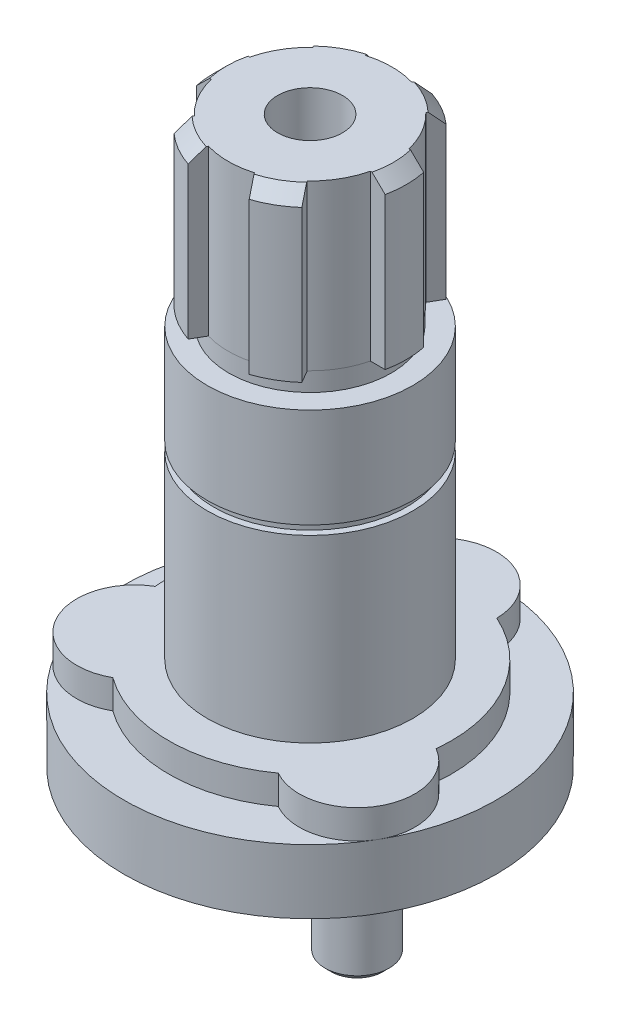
ISO-10303-21;
HEADER;
FILE_DESCRIPTION(('STEP AP214'),'2;1');
FILE_NAME('part.step','',(''),(''),'','','');
FILE_SCHEMA(('AUTOMOTIVE_DESIGN { 1 0 10303 214 1 1 1 1 }'));
ENDSEC;
DATA;
#1=APPLICATION_CONTEXT('core data for automotive mechanical design processes');
#2=APPLICATION_PROTOCOL_DEFINITION('international standard','automotive_design',2000,#1);
#3=PRODUCT_CONTEXT('',#1,'mechanical');
#4=PRODUCT('Part','Part','',(#3));
#5=PRODUCT_RELATED_PRODUCT_CATEGORY('part','',(#4));
#6=PRODUCT_DEFINITION_FORMATION('','',#4);
#7=PRODUCT_DEFINITION_CONTEXT('part definition',#1,'design');
#8=PRODUCT_DEFINITION('design','',#6,#7);
#9=PRODUCT_DEFINITION_SHAPE('','',#8);
#10=(LENGTH_UNIT() NAMED_UNIT(*) SI_UNIT(.MILLI.,.METRE.));
#11=(NAMED_UNIT(*) PLANE_ANGLE_UNIT() SI_UNIT($,.RADIAN.));
#12=(NAMED_UNIT(*) SI_UNIT($,.STERADIAN.) SOLID_ANGLE_UNIT());
#13=UNCERTAINTY_MEASURE_WITH_UNIT(LENGTH_MEASURE(1.E-05),#10,'distance_accuracy_value','');
#14=(GEOMETRIC_REPRESENTATION_CONTEXT(3) GLOBAL_UNCERTAINTY_ASSIGNED_CONTEXT((#13)) GLOBAL_UNIT_ASSIGNED_CONTEXT((#10,
#11,#12)) REPRESENTATION_CONTEXT('',''));
#15=CARTESIAN_POINT('',(0.,0.,0.));
#16=DIRECTION('',(0.,0.,1.));
#17=DIRECTION('',(1.,0.,0.));
#18=AXIS2_PLACEMENT_3D('',#15,#16,#17);
#19=CARTESIAN_POINT('',(0.,-12.001,0.));
#20=DIRECTION('',(0.,1.,0.));
#21=DIRECTION('',(0.,0.,1.));
#22=AXIS2_PLACEMENT_3D('',#19,#20,#21);
#23=CYLINDRICAL_SURFACE('',#22,15.);
#24=DIRECTION('',(0.,1.,0.));
#25=VECTOR('',#24,1.);
#26=CARTESIAN_POINT('',(14.6969384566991,-12.001,-2.99999999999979));
#27=LINE('',#26,#25);
#28=CARTESIAN_POINT('',(14.6969384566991,62.4,-2.99999999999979));
#29=VERTEX_POINT('',#28);
#30=CARTESIAN_POINT('',(14.6969384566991,86.,-2.99999999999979));
#31=VERTEX_POINT('',#30);
#32=EDGE_CURVE('E1149',#29,#31,#27,.T.);
#33=ORIENTED_EDGE('',*,*,#32,.T.);
#34=CARTESIAN_POINT('',(0.,86.,0.));
#35=DIRECTION('',(0.,1.,0.));
#36=DIRECTION('',(0.,0.,1.));
#37=AXIS2_PLACEMENT_3D('',#34,#35,#36);
#38=CIRCLE('',#37,15.);
#39=CARTESIAN_POINT('',(14.6969384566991,86.,3.));
#40=VERTEX_POINT('',#39);
#41=EDGE_CURVE('E26',#31,#40,#38,.F.);
#42=ORIENTED_EDGE('',*,*,#41,.T.);
#43=DIRECTION('',(0.,1.,0.));
#44=VECTOR('',#43,1.);
#45=CARTESIAN_POINT('',(14.6969384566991,-12.001,3.));
#46=LINE('',#45,#44);
#47=CARTESIAN_POINT('',(14.6969384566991,62.4,3.));
#48=VERTEX_POINT('',#47);
#49=EDGE_CURVE('E553',#40,#48,#46,.F.);
#50=ORIENTED_EDGE('',*,*,#49,.T.);
#51=CARTESIAN_POINT('',(0.,62.4,0.));
#52=DIRECTION('',(0.,1.,0.));
#53=DIRECTION('',(0.,0.,1.));
#54=AXIS2_PLACEMENT_3D('',#51,#52,#53);
#55=CIRCLE('',#54,15.);
#56=EDGE_CURVE('E397',#29,#48,#55,.F.);
#57=ORIENTED_EDGE('',*,*,#56,.F.);
#58=EDGE_LOOP('',(#33,#42,#50,#57));
#59=FACE_BOUND('',#58,.T.);
#60=ADVANCED_FACE('F17',(#59),#23,.T.);
#61=CARTESIAN_POINT('',(0.,88.,0.));
#62=DIRECTION('',(0.,-1.,0.));
#63=DIRECTION('',(0.,0.,-1.));
#64=AXIS2_PLACEMENT_3D('',#61,#62,#63);
#65=CONICAL_SURFACE('',#64,13.,0.785398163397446);
#66=CARTESIAN_POINT('',(18.2080464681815,82.5464649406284,-2.99999999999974));
#67=CARTESIAN_POINT('',(17.838852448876,82.9107454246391,-2.99999999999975));
#68=CARTESIAN_POINT('',(17.4695149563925,83.2748803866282,-2.99999999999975));
#69=CARTESIAN_POINT('',(16.7304863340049,84.0027912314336,-2.99999999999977));
#70=CARTESIAN_POINT('',(16.3607952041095,84.366567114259,-2.99999999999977));
#71=CARTESIAN_POINT('',(15.2511038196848,85.4572418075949,-2.99999999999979));
#72=CARTESIAN_POINT('',(14.5104730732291,86.183500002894,-2.99999999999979));
#73=CARTESIAN_POINT('',(13.3975616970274,87.2708879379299,-2.99999999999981));
#74=CARTESIAN_POINT('',(13.0262607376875,87.6330202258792,-2.99999999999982));
#75=CARTESIAN_POINT('',(12.2828158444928,88.3564173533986,-2.99999999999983));
#76=CARTESIAN_POINT('',(11.9106719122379,88.7176821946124,-2.99999999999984));
#77=CARTESIAN_POINT('',(11.1652821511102,89.4390869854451,-2.99999999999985));
#78=CARTESIAN_POINT('',(10.7920363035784,89.7992269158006,-2.99999999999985));
#79=CARTESIAN_POINT('',(10.2310648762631,90.3382918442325,-2.99999999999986));
#80=CARTESIAN_POINT('',(10.0438900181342,90.5177899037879,-2.99999999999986));
#81=CARTESIAN_POINT('',(9.66910568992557,90.8763322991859,-2.99999999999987));
#82=CARTESIAN_POINT('',(9.4814962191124,91.0553766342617,-2.99999999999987));
#83=CARTESIAN_POINT('',(9.29363602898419,91.234157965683,-2.99999999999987));
#84=B_SPLINE_CURVE_WITH_KNOTS('',3,(#66,#67,#68,#69,#70,#71,#72,#73,#74,#75,#76,#77,#78,#79,#80,
#81,#82,#83),.UNSPECIFIED.,.F.,.F.,(4,2,2,2,2,2,2,2,4),(0.,1.55596904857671,3.11193805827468,
6.22382338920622,7.77979077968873,9.33575521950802,10.8917461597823,11.6697466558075,
12.4477484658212),.UNSPECIFIED.);
#85=CARTESIAN_POINT('',(12.6491106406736,88.,-2.99999999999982));
#86=VERTEX_POINT('',#85);
#87=EDGE_CURVE('E273',#31,#86,#84,.T.);
#88=ORIENTED_EDGE('',*,*,#87,.T.);
#89=CARTESIAN_POINT('',(0.,88.,0.));
#90=DIRECTION('',(0.,1.,0.));
#91=DIRECTION('',(0.,0.,1.));
#92=AXIS2_PLACEMENT_3D('',#89,#90,#91);
#93=CIRCLE('',#92,13.);
#94=CARTESIAN_POINT('',(12.6491106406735,88.,3.));
#95=VERTEX_POINT('',#94);
#96=EDGE_CURVE('E404',#95,#86,#93,.T.);
#97=ORIENTED_EDGE('',*,*,#96,.F.);
#98=CARTESIAN_POINT('',(9.29363602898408,91.2341579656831,3.));
#99=CARTESIAN_POINT('',(9.48149621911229,91.0553766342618,3.));
#100=CARTESIAN_POINT('',(9.66910568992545,90.876332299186,3.));
#101=CARTESIAN_POINT('',(10.0438900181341,90.5177899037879,3.));
#102=CARTESIAN_POINT('',(10.231064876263,90.3382918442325,3.));
#103=CARTESIAN_POINT('',(10.7920363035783,89.7992269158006,3.));
#104=CARTESIAN_POINT('',(11.1652821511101,89.4390869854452,3.));
#105=CARTESIAN_POINT('',(11.9106719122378,88.7176821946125,3.));
#106=CARTESIAN_POINT('',(12.2828158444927,88.3564173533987,3.));
#107=CARTESIAN_POINT('',(13.0262607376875,87.6330202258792,3.));
#108=CARTESIAN_POINT('',(13.3975616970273,87.2708879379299,3.));
#109=CARTESIAN_POINT('',(14.510473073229,86.183500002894,3.));
#110=CARTESIAN_POINT('',(15.2511038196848,85.4572418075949,3.));
#111=CARTESIAN_POINT('',(16.3607952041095,84.366567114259,3.));
#112=CARTESIAN_POINT('',(16.7304863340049,84.0027912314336,3.));
#113=CARTESIAN_POINT('',(17.4695149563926,83.2748803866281,3.));
#114=CARTESIAN_POINT('',(17.838852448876,82.910745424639,3.));
#115=CARTESIAN_POINT('',(18.2080464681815,82.5464649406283,3.));
#116=B_SPLINE_CURVE_WITH_KNOTS('',3,(#98,#99,#100,#101,#102,#103,#104,#105,#106,#107,#108,#109,
#110,#111,#112,#113,#114,#115),.UNSPECIFIED.,.F.,.F.,(4,2,2,2,2,2,2,2,4),(0.,0.778001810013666,
1.55600230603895,3.11199324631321,4.66795768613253,6.22392507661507,9.33581040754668,
10.8917794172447,12.4477484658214),.UNSPECIFIED.);
#117=EDGE_CURVE('E556',#95,#40,#116,.T.);
#118=ORIENTED_EDGE('',*,*,#117,.T.);
#119=ORIENTED_EDGE('',*,*,#41,.F.);
#120=EDGE_LOOP('',(#88,#97,#118,#119));
#121=FACE_BOUND('',#120,.T.);
#122=ADVANCED_FACE('F310',(#121),#65,.T.);
#123=DIRECTION('',(0.,1.,0.));
#124=VECTOR('',#123,1.);
#125=CARTESIAN_POINT('',(9.94654543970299,-12.001,-11.2279220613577));
#126=LINE('',#125,#124);
#127=CARTESIAN_POINT('',(9.94654543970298,86.,-11.2279220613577));
#128=VERTEX_POINT('',#127);
#129=CARTESIAN_POINT('',(9.94654543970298,62.4,-11.2279220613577));
#130=VERTEX_POINT('',#129);
#131=EDGE_CURVE('E1167',#128,#130,#126,.F.);
#132=ORIENTED_EDGE('',*,*,#131,.T.);
#133=CARTESIAN_POINT('',(4.75039301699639,62.4,-14.2279220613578));
#134=VERTEX_POINT('',#133);
#135=EDGE_CURVE('E392',#134,#130,#55,.F.);
#136=ORIENTED_EDGE('',*,*,#135,.F.);
#137=DIRECTION('',(0.,1.,0.));
#138=VECTOR('',#137,1.);
#139=CARTESIAN_POINT('',(4.75039301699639,-12.001,-14.2279220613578));
#140=LINE('',#139,#138);
#141=CARTESIAN_POINT('',(4.75039301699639,86.,-14.2279220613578));
#142=VERTEX_POINT('',#141);
#143=EDGE_CURVE('E704',#134,#142,#140,.T.);
#144=ORIENTED_EDGE('',*,*,#143,.T.);
#145=EDGE_CURVE('E412',#142,#128,#38,.F.);
#146=ORIENTED_EDGE('',*,*,#145,.T.);
#147=EDGE_LOOP('',(#132,#136,#144,#146));
#148=FACE_BOUND('',#147,.T.);
#149=ADVANCED_FACE('F313',(#148),#23,.T.);
#150=CARTESIAN_POINT('',(8.92252875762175,88.0002,-9.45427314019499));
#151=CARTESIAN_POINT('',(9.00802711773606,87.8338179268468,-9.60236064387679));
#152=CARTESIAN_POINT('',(9.09348104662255,87.6673445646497,-9.75037119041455));
#153=CARTESIAN_POINT('',(9.26430867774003,87.3342335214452,-10.0462533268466));
#154=CARTESIAN_POINT('',(9.34968238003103,87.167595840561,-10.1941249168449));
#155=CARTESIAN_POINT('',(9.52035830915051,86.8341741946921,-10.4897442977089));
#156=CARTESIAN_POINT('',(9.60566053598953,86.6673902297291,-10.6374920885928));
#157=CARTESIAN_POINT('',(9.77620058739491,86.333690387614,-10.9328761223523));
#158=CARTESIAN_POINT('',(9.86143841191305,86.1667745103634,-11.0805123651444));
#159=CARTESIAN_POINT('',(9.94664750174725,85.9998,-11.2280988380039));
#160=B_SPLINE_CURVE_WITH_KNOTS('',3,(#150,#151,#152,#153,#154,#155,#156,#157,#158,#159),
.UNSPECIFIED.,.F.,.F.,(4,2,2,2,4),(0.,0.715755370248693,1.43151020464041,2.14726493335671,
2.86302019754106),.UNSPECIFIED.);
#161=CARTESIAN_POINT('',(8.92263153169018,88.,-9.45445115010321));
#162=VERTEX_POINT('',#161);
#163=EDGE_CURVE('E277',#162,#128,#160,.T.);
#164=ORIENTED_EDGE('',*,*,#163,.T.);
#165=ORIENTED_EDGE('',*,*,#145,.F.);
#166=CARTESIAN_POINT('',(4.75049507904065,85.9998,-14.228098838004));
#167=CARTESIAN_POINT('',(4.66528598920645,86.1667745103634,-14.0805123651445));
#168=CARTESIAN_POINT('',(4.58004816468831,86.333690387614,-13.9328761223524));
#169=CARTESIAN_POINT('',(4.40950811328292,86.6673902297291,-13.6374920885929));
#170=CARTESIAN_POINT('',(4.32420588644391,86.8341741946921,-13.4897442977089));
#171=CARTESIAN_POINT('',(4.15352995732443,87.167595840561,-13.194124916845));
#172=CARTESIAN_POINT('',(4.06815625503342,87.3342335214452,-13.0462533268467));
#173=CARTESIAN_POINT('',(3.89732862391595,87.6673445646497,-12.7503711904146));
#174=CARTESIAN_POINT('',(3.81187469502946,87.8338179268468,-12.6023606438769));
#175=CARTESIAN_POINT('',(3.72637633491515,88.0002,-12.4542731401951));
#176=B_SPLINE_CURVE_WITH_KNOTS('',3,(#166,#167,#168,#169,#170,#171,#172,#173,#174,#175),
.UNSPECIFIED.,.F.,.F.,(4,2,2,2,4),(0.,0.715755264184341,1.43150999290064,2.14726482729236,
2.86302019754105),.UNSPECIFIED.);
#177=CARTESIAN_POINT('',(3.72647910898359,88.,-12.4544511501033));
#178=VERTEX_POINT('',#177);
#179=EDGE_CURVE('E677',#142,#178,#176,.T.);
#180=ORIENTED_EDGE('',*,*,#179,.T.);
#181=EDGE_CURVE('E406',#162,#178,#93,.T.);
#182=ORIENTED_EDGE('',*,*,#181,.F.);
#183=EDGE_LOOP('',(#164,#165,#180,#182));
#184=FACE_BOUND('',#183,.T.);
#185=ADVANCED_FACE('F320',(#184),#65,.T.);
#186=DIRECTION('',(0.,1.,0.));
#187=VECTOR('',#186,1.);
#188=CARTESIAN_POINT('',(-4.75039301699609,-12.001,-14.2279220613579));
#189=LINE('',#188,#187);
#190=CARTESIAN_POINT('',(-4.75039301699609,86.,-14.2279220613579));
#191=VERTEX_POINT('',#190);
#192=CARTESIAN_POINT('',(-4.75039301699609,62.4,-14.2279220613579));
#193=VERTEX_POINT('',#192);
#194=EDGE_CURVE('E371',#191,#193,#189,.F.);
#195=ORIENTED_EDGE('',*,*,#194,.T.);
#196=CARTESIAN_POINT('',(-9.94654543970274,62.4,-11.2279220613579));
#197=VERTEX_POINT('',#196);
#198=EDGE_CURVE('E374',#197,#193,#55,.F.);
#199=ORIENTED_EDGE('',*,*,#198,.F.);
#200=DIRECTION('',(0.,1.,0.));
#201=VECTOR('',#200,1.);
#202=CARTESIAN_POINT('',(-9.94654543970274,-12.001,-11.2279220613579));
#203=LINE('',#202,#201);
#204=CARTESIAN_POINT('',(-9.94654543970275,86.,-11.2279220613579));
#205=VERTEX_POINT('',#204);
#206=EDGE_CURVE('E780',#197,#205,#203,.T.);
#207=ORIENTED_EDGE('',*,*,#206,.T.);
#208=EDGE_CURVE('E376',#205,#191,#38,.F.);
#209=ORIENTED_EDGE('',*,*,#208,.T.);
#210=EDGE_LOOP('',(#195,#199,#207,#209));
#211=FACE_BOUND('',#210,.T.);
#212=ADVANCED_FACE('F327',(#211),#23,.T.);
#213=CARTESIAN_POINT('',(-3.7263763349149,88.0002,-12.4542731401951));
#214=CARTESIAN_POINT('',(-3.8118746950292,87.8338179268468,-12.6023606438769));
#215=CARTESIAN_POINT('',(-3.89732862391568,87.6673445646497,-12.7503711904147));
#216=CARTESIAN_POINT('',(-4.06815625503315,87.3342335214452,-13.0462533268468));
#217=CARTESIAN_POINT('',(-4.15352995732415,87.167595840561,-13.1941249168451));
#218=CARTESIAN_POINT('',(-4.32420588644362,86.8341741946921,-13.489744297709));
#219=CARTESIAN_POINT('',(-4.40950811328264,86.6673902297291,-13.637492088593));
#220=CARTESIAN_POINT('',(-4.58004816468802,86.333690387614,-13.9328761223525));
#221=CARTESIAN_POINT('',(-4.66528598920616,86.1667745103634,-14.0805123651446));
#222=CARTESIAN_POINT('',(-4.75049507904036,85.9998,-14.2280988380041));
#223=B_SPLINE_CURVE_WITH_KNOTS('',3,(#213,#214,#215,#216,#217,#218,#219,#220,#221,#222),
.UNSPECIFIED.,.F.,.F.,(4,2,2,2,4),(0.,0.715755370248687,1.43151020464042,2.14726493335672,
2.86302019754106),.UNSPECIFIED.);
#224=CARTESIAN_POINT('',(-3.72647910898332,88.,-12.4544511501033));
#225=VERTEX_POINT('',#224);
#226=EDGE_CURVE('E379',#225,#191,#223,.T.);
#227=ORIENTED_EDGE('',*,*,#226,.T.);
#228=ORIENTED_EDGE('',*,*,#208,.F.);
#229=CARTESIAN_POINT('',(-9.94664750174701,85.9998,-11.2280988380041));
#230=CARTESIAN_POINT('',(-9.86143841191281,86.1667745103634,-11.0805123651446));
#231=CARTESIAN_POINT('',(-9.77620058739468,86.333690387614,-10.9328761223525));
#232=CARTESIAN_POINT('',(-9.6056605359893,86.6673902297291,-10.637492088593));
#233=CARTESIAN_POINT('',(-9.52035830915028,86.8341741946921,-10.4897442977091));
#234=CARTESIAN_POINT('',(-9.34968238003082,87.167595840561,-10.1941249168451));
#235=CARTESIAN_POINT('',(-9.26430867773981,87.3342335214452,-10.0462533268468));
#236=CARTESIAN_POINT('',(-9.09348104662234,87.6673445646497,-9.75037119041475));
#237=CARTESIAN_POINT('',(-9.00802711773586,87.8338179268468,-9.60236064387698));
#238=CARTESIAN_POINT('',(-8.92252875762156,88.0002,-9.45427314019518));
#239=B_SPLINE_CURVE_WITH_KNOTS('',3,(#229,#230,#231,#232,#233,#234,#235,#236,#237,#238),
.UNSPECIFIED.,.F.,.F.,(4,2,2,2,4),(0.,0.715755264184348,1.43150999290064,2.14726482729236,
2.86302019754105),.UNSPECIFIED.);
#240=CARTESIAN_POINT('',(-8.92263153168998,88.,-9.4544511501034));
#241=VERTEX_POINT('',#240);
#242=EDGE_CURVE('E649',#205,#241,#239,.T.);
#243=ORIENTED_EDGE('',*,*,#242,.T.);
#244=EDGE_CURVE('E413',#225,#241,#93,.T.);
#245=ORIENTED_EDGE('',*,*,#244,.F.);
#246=EDGE_LOOP('',(#227,#228,#243,#245));
#247=FACE_BOUND('',#246,.T.);
#248=ADVANCED_FACE('F353',(#247),#65,.T.);
#249=DIRECTION('',(0.,1.,0.));
#250=VECTOR('',#249,1.);
#251=CARTESIAN_POINT('',(-14.696938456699,-12.001,-3.0000000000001));
#252=LINE('',#251,#250);
#253=CARTESIAN_POINT('',(-14.696938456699,86.,-3.0000000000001));
#254=VERTEX_POINT('',#253);
#255=CARTESIAN_POINT('',(-14.696938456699,62.4,-3.0000000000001));
#256=VERTEX_POINT('',#255);
#257=EDGE_CURVE('E762',#254,#256,#252,.F.);
#258=ORIENTED_EDGE('',*,*,#257,.T.);
#259=CARTESIAN_POINT('',(-14.6969384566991,62.4,2.9999999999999));
#260=VERTEX_POINT('',#259);
#261=EDGE_CURVE('E391',#260,#256,#55,.F.);
#262=ORIENTED_EDGE('',*,*,#261,.F.);
#263=DIRECTION('',(0.,1.,0.));
#264=VECTOR('',#263,1.);
#265=CARTESIAN_POINT('',(-14.6969384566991,-12.001,2.9999999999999));
#266=LINE('',#265,#264);
#267=CARTESIAN_POINT('',(-14.6969384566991,86.,2.9999999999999));
#268=VERTEX_POINT('',#267);
#269=EDGE_CURVE('E748',#260,#268,#266,.T.);
#270=ORIENTED_EDGE('',*,*,#269,.T.);
#271=EDGE_CURVE('E716',#268,#254,#38,.F.);
#272=ORIENTED_EDGE('',*,*,#271,.T.);
#273=EDGE_LOOP('',(#258,#262,#270,#272));
#274=FACE_BOUND('',#273,.T.);
#275=ADVANCED_FACE('F345',(#274),#23,.T.);
#276=CARTESIAN_POINT('',(-9.96821665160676,90.590132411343,-3.00000000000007));
#277=CARTESIAN_POINT('',(-10.3428019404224,90.2313878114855,-3.00000000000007));
#278=CARTESIAN_POINT('',(-10.7165999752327,89.8718239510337,-3.00000000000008));
#279=CARTESIAN_POINT('',(-11.4629436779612,89.1514017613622,-3.00000000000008));
#280=CARTESIAN_POINT('',(-11.8354893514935,88.7905434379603,-3.00000000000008));
#281=CARTESIAN_POINT('',(-12.5796491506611,88.0678776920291,-3.00000000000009));
#282=CARTESIAN_POINT('',(-12.9512632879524,87.7060702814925,-3.00000000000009));
#283=CARTESIAN_POINT('',(-13.6937633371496,86.98170820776,-3.0000000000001));
#284=CARTESIAN_POINT('',(-14.0646492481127,86.6191535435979,-3.0000000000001));
#285=CARTESIAN_POINT('',(-15.1764442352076,85.5306251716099,-3.0000000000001));
#286=CARTESIAN_POINT('',(-15.9164989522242,84.8037789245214,-3.00000000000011));
#287=CARTESIAN_POINT('',(-17.0254645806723,83.712367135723,-3.00000000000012));
#288=CARTESIAN_POINT('',(-17.3949360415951,83.34837050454,-3.00000000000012));
#289=CARTESIAN_POINT('',(-18.1335628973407,82.6200567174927,-3.00000000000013));
#290=CARTESIAN_POINT('',(-18.5027182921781,82.255739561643,-3.00000000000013));
#291=CARTESIAN_POINT('',(-18.8717444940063,81.891291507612,-3.00000000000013));
#292=B_SPLINE_CURVE_WITH_KNOTS('',3,(#276,#277,#278,#279,#280,#281,#282,#283,#284,#285,#286,
#287,#288,#289,#290,#291),.UNSPECIFIED.,.F.,.F.,(4,2,2,2,2,2,2,4),(0.,1.55598652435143,
3.11196606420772,4.66792603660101,6.22388802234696,9.3357768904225,10.8917409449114,
12.4477049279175),.UNSPECIFIED.);
#293=CARTESIAN_POINT('',(-12.6491106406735,88.,-3.00000000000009));
#294=VERTEX_POINT('',#293);
#295=EDGE_CURVE('E656',#294,#254,#292,.T.);
#296=ORIENTED_EDGE('',*,*,#295,.T.);
#297=ORIENTED_EDGE('',*,*,#271,.F.);
#298=CARTESIAN_POINT('',(-18.8717444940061,81.8912915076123,2.99999999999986));
#299=CARTESIAN_POINT('',(-18.5027182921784,82.2557395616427,2.99999999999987));
#300=CARTESIAN_POINT('',(-18.1335628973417,82.6200567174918,2.99999999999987));
#301=CARTESIAN_POINT('',(-17.3949360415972,83.348370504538,2.99999999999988));
#302=CARTESIAN_POINT('',(-17.025464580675,83.7123671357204,2.99999999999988));
#303=CARTESIAN_POINT('',(-15.9164989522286,84.8037789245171,2.99999999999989));
#304=CARTESIAN_POINT('',(-15.1764442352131,85.5306251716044,2.99999999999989));
#305=CARTESIAN_POINT('',(-14.0646492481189,86.6191535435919,2.9999999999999));
#306=CARTESIAN_POINT('',(-13.6937633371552,86.9817082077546,2.9999999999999));
#307=CARTESIAN_POINT('',(-12.9512632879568,87.7060702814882,2.99999999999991));
#308=CARTESIAN_POINT('',(-12.579649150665,88.0678776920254,2.99999999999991));
#309=CARTESIAN_POINT('',(-11.8354893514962,88.7905434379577,2.99999999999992));
#310=CARTESIAN_POINT('',(-11.4629436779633,89.1514017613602,2.99999999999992));
#311=CARTESIAN_POINT('',(-10.7165999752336,89.8718239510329,2.99999999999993));
#312=CARTESIAN_POINT('',(-10.3428019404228,90.2313878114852,2.99999999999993));
#313=CARTESIAN_POINT('',(-9.96821665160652,90.5901324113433,2.99999999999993));
#314=B_SPLINE_CURVE_WITH_KNOTS('',3,(#298,#299,#300,#301,#302,#303,#304,#305,#306,#307,#308,
#309,#310,#311,#312,#313),.UNSPECIFIED.,.F.,.F.,(4,2,2,2,2,2,2,4),(0.,1.55596398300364,
3.11192803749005,6.22381690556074,7.77977889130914,9.33573886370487,10.8917184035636,
12.4477049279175),.UNSPECIFIED.);
#315=CARTESIAN_POINT('',(-12.6491106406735,88.,2.99999999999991));
#316=VERTEX_POINT('',#315);
#317=EDGE_CURVE('E620',#268,#316,#314,.T.);
#318=ORIENTED_EDGE('',*,*,#317,.T.);
#319=EDGE_CURVE('E419',#294,#316,#93,.T.);
#320=ORIENTED_EDGE('',*,*,#319,.F.);
#321=EDGE_LOOP('',(#296,#297,#318,#320));
#322=FACE_BOUND('',#321,.T.);
#323=ADVANCED_FACE('F343',(#322),#65,.T.);
#324=DIRECTION('',(0.,1.,0.));
#325=VECTOR('',#324,1.);
#326=CARTESIAN_POINT('',(-9.9465454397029,-12.001,11.2279220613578));
#327=LINE('',#326,#325);
#328=CARTESIAN_POINT('',(-9.9465454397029,86.,11.2279220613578));
#329=VERTEX_POINT('',#328);
#330=CARTESIAN_POINT('',(-9.9465454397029,62.4,11.2279220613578));
#331=VERTEX_POINT('',#330);
#332=EDGE_CURVE('E724',#329,#331,#327,.F.);
#333=ORIENTED_EDGE('',*,*,#332,.T.);
#334=CARTESIAN_POINT('',(-4.75039301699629,62.4,14.2279220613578));
#335=VERTEX_POINT('',#334);
#336=EDGE_CURVE('E395',#335,#331,#55,.F.);
#337=ORIENTED_EDGE('',*,*,#336,.F.);
#338=DIRECTION('',(0.,1.,0.));
#339=VECTOR('',#338,1.);
#340=CARTESIAN_POINT('',(-4.75039301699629,-12.001,14.2279220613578));
#341=LINE('',#340,#339);
#342=CARTESIAN_POINT('',(-4.75039301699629,86.,14.2279220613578));
#343=VERTEX_POINT('',#342);
#344=EDGE_CURVE('E726',#335,#343,#341,.T.);
#345=ORIENTED_EDGE('',*,*,#344,.T.);
#346=EDGE_CURVE('E25',#343,#329,#38,.F.);
#347=ORIENTED_EDGE('',*,*,#346,.T.);
#348=EDGE_LOOP('',(#333,#337,#345,#347));
#349=FACE_BOUND('',#348,.T.);
#350=ADVANCED_FACE('F331',(#349),#23,.T.);
#351=CARTESIAN_POINT('',(-8.92252875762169,88.0002,9.45427314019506));
#352=CARTESIAN_POINT('',(-9.008027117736,87.8338179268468,9.60236064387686));
#353=CARTESIAN_POINT('',(-9.09348104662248,87.6673445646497,9.75037119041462));
#354=CARTESIAN_POINT('',(-9.26430867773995,87.3342335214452,10.0462533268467));
#355=CARTESIAN_POINT('',(-9.34968238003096,87.167595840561,10.194124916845));
#356=CARTESIAN_POINT('',(-9.52035830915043,86.8341741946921,10.4897442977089));
#357=CARTESIAN_POINT('',(-9.60566053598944,86.6673902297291,10.6374920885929));
#358=CARTESIAN_POINT('',(-9.77620058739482,86.333690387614,10.9328761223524));
#359=CARTESIAN_POINT('',(-9.86143841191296,86.1667745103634,11.0805123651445));
#360=CARTESIAN_POINT('',(-9.94664750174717,85.9998,11.228098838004));
#361=B_SPLINE_CURVE_WITH_KNOTS('',3,(#351,#352,#353,#354,#355,#356,#357,#358,#359,#360),
.UNSPECIFIED.,.F.,.F.,(4,2,2,2,4),(0.,0.71575537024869,1.43151020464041,2.14726493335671,
2.86302019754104),.UNSPECIFIED.);
#362=CARTESIAN_POINT('',(-8.92263153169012,88.,9.45445115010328));
#363=VERTEX_POINT('',#362);
#364=EDGE_CURVE('E627',#363,#329,#361,.T.);
#365=ORIENTED_EDGE('',*,*,#364,.T.);
#366=ORIENTED_EDGE('',*,*,#346,.F.);
#367=CARTESIAN_POINT('',(-4.75049507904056,85.9998,14.228098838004));
#368=CARTESIAN_POINT('',(-4.66528598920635,86.1667745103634,14.0805123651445));
#369=CARTESIAN_POINT('',(-4.58004816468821,86.333690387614,13.9328761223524));
#370=CARTESIAN_POINT('',(-4.40950811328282,86.6673902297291,13.6374920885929));
#371=CARTESIAN_POINT('',(-4.3242058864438,86.8341741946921,13.489744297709));
#372=CARTESIAN_POINT('',(-4.15352995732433,87.167595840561,13.194124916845));
#373=CARTESIAN_POINT('',(-4.06815625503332,87.3342335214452,13.0462533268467));
#374=CARTESIAN_POINT('',(-3.89732862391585,87.6673445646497,12.7503711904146));
#375=CARTESIAN_POINT('',(-3.81187469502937,87.8338179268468,12.6023606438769));
#376=CARTESIAN_POINT('',(-3.72637633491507,88.0002,12.4542731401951));
#377=B_SPLINE_CURVE_WITH_KNOTS('',3,(#367,#368,#369,#370,#371,#372,#373,#374,#375,#376),
.UNSPECIFIED.,.F.,.F.,(4,2,2,2,4),(0.,0.715755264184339,1.43150999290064,2.14726482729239,
2.86302019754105),.UNSPECIFIED.);
#378=CARTESIAN_POINT('',(-3.7264791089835,88.,12.4544511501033));
#379=VERTEX_POINT('',#378);
#380=EDGE_CURVE('E590',#343,#379,#377,.T.);
#381=ORIENTED_EDGE('',*,*,#380,.T.);
#382=EDGE_CURVE('E414',#363,#379,#93,.T.);
#383=ORIENTED_EDGE('',*,*,#382,.F.);
#384=EDGE_LOOP('',(#365,#366,#381,#383));
#385=FACE_BOUND('',#384,.T.);
#386=ADVANCED_FACE('F337',(#385),#65,.T.);
#387=CARTESIAN_POINT('',(0.,42.5,0.));
#388=DIRECTION('',(0.,1.,0.));
#389=DIRECTION('',(0.,0.,1.));
#390=AXIS2_PLACEMENT_3D('',#387,#388,#389);
#391=PLANE('',#390);
#392=CARTESIAN_POINT('',(0.,42.5,0.));
#393=DIRECTION('',(0.,1.,0.));
#394=DIRECTION('',(0.,0.,1.));
#395=AXIS2_PLACEMENT_3D('',#392,#393,#394);
#396=CIRCLE('',#395,16.);
#397=CARTESIAN_POINT('',(0.,42.5,16.));
#398=VERTEX_POINT('',#397);
#399=EDGE_CURVE('E508',#398,#398,#396,.T.);
#400=ORIENTED_EDGE('',*,*,#399,.T.);
#401=EDGE_LOOP('',(#400));
#402=FACE_BOUND('',#401,.T.);
#403=CARTESIAN_POINT('',(0.,42.5,0.));
#404=DIRECTION('',(0.,1.,0.));
#405=DIRECTION('',(0.,0.,1.));
#406=AXIS2_PLACEMENT_3D('',#403,#404,#405);
#407=CIRCLE('',#406,15.);
#408=CARTESIAN_POINT('',(0.,42.5,15.));
#409=VERTEX_POINT('',#408);
#410=EDGE_CURVE('E517',#409,#409,#407,.T.);
#411=ORIENTED_EDGE('',*,*,#410,.F.);
#412=EDGE_LOOP('',(#411));
#413=FACE_BOUND('',#412,.T.);
#414=ADVANCED_FACE('F349',(#402,#413),#391,.T.);
#415=CARTESIAN_POINT('',(0.,14.5,-10.));
#416=DIRECTION('',(0.,1.,0.));
#417=DIRECTION('',(0.,0.,1.));
#418=AXIS2_PLACEMENT_3D('',#415,#416,#417);
#419=PLANE('',#418);
#420=CARTESIAN_POINT('',(0.,14.5,-20.));
#421=DIRECTION('',(0.,1.,0.));
#422=DIRECTION('',(0.,0.,1.));
#423=AXIS2_PLACEMENT_3D('',#420,#421,#422);
#424=CIRCLE('',#423,9.);
#425=CARTESIAN_POINT('',(8.99968749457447,14.5,-20.075));
#426=VERTEX_POINT('',#425);
#427=CARTESIAN_POINT('',(-8.99968749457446,14.5,-20.075));
#428=VERTEX_POINT('',#427);
#429=EDGE_CURVE('E505',#426,#428,#424,.T.);
#430=ORIENTED_EDGE('',*,*,#429,.T.);
#431=CARTESIAN_POINT('',(0.,14.5,0.));
#432=DIRECTION('',(0.,1.,0.));
#433=DIRECTION('',(0.,0.,1.));
#434=AXIS2_PLACEMENT_3D('',#431,#432,#433);
#435=CIRCLE('',#434,22.);
#436=CARTESIAN_POINT('',(-21.8853037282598,14.5,2.24354200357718));
#437=VERTEX_POINT('',#436);
#438=EDGE_CURVE('E503',#428,#437,#435,.T.);
#439=ORIENTED_EDGE('',*,*,#438,.T.);
#440=CARTESIAN_POINT('',(-17.3205080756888,14.5,9.99999999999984));
#441=DIRECTION('',(0.,1.,0.));
#442=DIRECTION('',(0.,0.,1.));
#443=AXIS2_PLACEMENT_3D('',#440,#441,#442);
#444=CIRCLE('',#443,9.);
#445=CARTESIAN_POINT('',(-12.8856162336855,14.5,17.8314579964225));
#446=VERTEX_POINT('',#445);
#447=EDGE_CURVE('E501',#437,#446,#444,.T.);
#448=ORIENTED_EDGE('',*,*,#447,.T.);
#449=CARTESIAN_POINT('',(0.,14.5,0.));
#450=DIRECTION('',(0.,1.,0.));
#451=DIRECTION('',(0.,0.,1.));
#452=AXIS2_PLACEMENT_3D('',#449,#450,#451);
#453=CIRCLE('',#452,22.);
#454=CARTESIAN_POINT('',(12.8856162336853,14.5,17.8314579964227));
#455=VERTEX_POINT('',#454);
#456=EDGE_CURVE('E499',#446,#455,#453,.T.);
#457=ORIENTED_EDGE('',*,*,#456,.T.);
#458=CARTESIAN_POINT('',(17.3205080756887,14.5,10.));
#459=DIRECTION('',(0.,1.,0.));
#460=DIRECTION('',(0.,0.,1.));
#461=AXIS2_PLACEMENT_3D('',#458,#459,#460);
#462=CIRCLE('',#461,9.);
#463=CARTESIAN_POINT('',(21.8853037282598,14.5,2.24354200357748));
#464=VERTEX_POINT('',#463);
#465=EDGE_CURVE('E497',#455,#464,#462,.T.);
#466=ORIENTED_EDGE('',*,*,#465,.T.);
#467=CARTESIAN_POINT('',(0.,14.5,0.));
#468=DIRECTION('',(0.,1.,0.));
#469=DIRECTION('',(0.,0.,1.));
#470=AXIS2_PLACEMENT_3D('',#467,#468,#469);
#471=CIRCLE('',#470,22.);
#472=EDGE_CURVE('E495',#464,#426,#471,.T.);
#473=ORIENTED_EDGE('',*,*,#472,.T.);
#474=EDGE_LOOP('',(#430,#439,#448,#457,#466,#473));
#475=FACE_BOUND('',#474,.T.);
#476=CARTESIAN_POINT('',(0.,14.5,0.));
#477=DIRECTION('',(0.,1.,0.));
#478=DIRECTION('',(0.,0.,1.));
#479=AXIS2_PLACEMENT_3D('',#476,#477,#478);
#480=CIRCLE('',#479,16.);
#481=CARTESIAN_POINT('',(0.,14.5,16.));
#482=VERTEX_POINT('',#481);
#483=EDGE_CURVE('E511',#482,#482,#480,.T.);
#484=ORIENTED_EDGE('',*,*,#483,.F.);
#485=EDGE_LOOP('',(#484));
#486=FACE_BOUND('',#485,.T.);
#487=ADVANCED_FACE('F886',(#475,#486),#419,.T.);
#488=CARTESIAN_POINT('',(0.,10.,0.));
#489=DIRECTION('',(0.,1.,0.));
#490=DIRECTION('',(0.,0.,1.));
#491=AXIS2_PLACEMENT_3D('',#488,#489,#490);
#492=PLANE('',#491);
#493=CARTESIAN_POINT('',(0.,10.,0.));
#494=DIRECTION('',(0.,1.,0.));
#495=DIRECTION('',(0.,0.,1.));
#496=AXIS2_PLACEMENT_3D('',#493,#494,#495);
#497=CIRCLE('',#496,29.);
#498=CARTESIAN_POINT('',(0.,10.,-29.));
#499=VERTEX_POINT('',#498);
#500=CARTESIAN_POINT('',(-25.1147367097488,10.,14.4999999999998));
#501=VERTEX_POINT('',#500);
#502=EDGE_CURVE('E443',#499,#501,#497,.T.);
#503=ORIENTED_EDGE('',*,*,#502,.T.);
#504=CARTESIAN_POINT('',(-17.3205080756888,10.,9.99999999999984));
#505=DIRECTION('',(0.,1.,0.));
#506=DIRECTION('',(0.,0.,1.));
#507=AXIS2_PLACEMENT_3D('',#504,#505,#506);
#508=CIRCLE('',#507,9.);
#509=CARTESIAN_POINT('',(-21.8853037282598,10.,2.24354200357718));
#510=VERTEX_POINT('',#509);
#511=EDGE_CURVE('E465',#501,#510,#508,.F.);
#512=ORIENTED_EDGE('',*,*,#511,.T.);
#513=CARTESIAN_POINT('',(0.,10.,0.));
#514=DIRECTION('',(0.,1.,0.));
#515=DIRECTION('',(0.,0.,1.));
#516=AXIS2_PLACEMENT_3D('',#513,#514,#515);
#517=CIRCLE('',#516,22.);
#518=CARTESIAN_POINT('',(-8.99968749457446,10.,-20.075));
#519=VERTEX_POINT('',#518);
#520=EDGE_CURVE('E461',#510,#519,#517,.F.);
#521=ORIENTED_EDGE('',*,*,#520,.T.);
#522=CARTESIAN_POINT('',(0.,10.,-20.));
#523=DIRECTION('',(0.,1.,0.));
#524=DIRECTION('',(0.,0.,1.));
#525=AXIS2_PLACEMENT_3D('',#522,#523,#524);
#526=CIRCLE('',#525,9.);
#527=EDGE_CURVE('E457',#519,#499,#526,.F.);
#528=ORIENTED_EDGE('',*,*,#527,.T.);
#529=EDGE_LOOP('',(#503,#512,#521,#528));
#530=FACE_BOUND('',#529,.T.);
#531=ADVANCED_FACE('F902',(#530),#492,.T.);
#532=CARTESIAN_POINT('',(0.,10.,0.));
#533=DIRECTION('',(0.,1.,0.));
#534=DIRECTION('',(0.,0.,1.));
#535=AXIS2_PLACEMENT_3D('',#532,#533,#534);
#536=CIRCLE('',#535,22.);
#537=CARTESIAN_POINT('',(12.8856162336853,10.,17.8314579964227));
#538=VERTEX_POINT('',#537);
#539=CARTESIAN_POINT('',(-12.8856162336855,10.,17.8314579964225));
#540=VERTEX_POINT('',#539);
#541=EDGE_CURVE('E468',#538,#540,#536,.F.);
#542=ORIENTED_EDGE('',*,*,#541,.T.);
#543=EDGE_CURVE('E464',#540,#501,#508,.F.);
#544=ORIENTED_EDGE('',*,*,#543,.T.);
#545=CARTESIAN_POINT('',(25.1147367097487,10.,14.5000000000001));
#546=VERTEX_POINT('',#545);
#547=EDGE_CURVE('E444',#501,#546,#497,.T.);
#548=ORIENTED_EDGE('',*,*,#547,.T.);
#549=CARTESIAN_POINT('',(17.3205080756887,10.,10.));
#550=DIRECTION('',(0.,1.,0.));
#551=DIRECTION('',(0.,0.,1.));
#552=AXIS2_PLACEMENT_3D('',#549,#550,#551);
#553=CIRCLE('',#552,9.);
#554=EDGE_CURVE('E472',#546,#538,#553,.F.);
#555=ORIENTED_EDGE('',*,*,#554,.T.);
#556=EDGE_LOOP('',(#542,#544,#548,#555));
#557=FACE_BOUND('',#556,.T.);
#558=ADVANCED_FACE('F974',(#557),#492,.T.);
#559=EDGE_CURVE('E440',#546,#499,#497,.T.);
#560=ORIENTED_EDGE('',*,*,#559,.T.);
#561=CARTESIAN_POINT('',(8.99968749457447,10.,-20.075));
#562=VERTEX_POINT('',#561);
#563=EDGE_CURVE('E458',#499,#562,#526,.F.);
#564=ORIENTED_EDGE('',*,*,#563,.T.);
#565=CARTESIAN_POINT('',(0.,10.,0.));
#566=DIRECTION('',(0.,1.,0.));
#567=DIRECTION('',(0.,0.,1.));
#568=AXIS2_PLACEMENT_3D('',#565,#566,#567);
#569=CIRCLE('',#568,22.);
#570=CARTESIAN_POINT('',(21.8853037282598,10.,2.24354200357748));
#571=VERTEX_POINT('',#570);
#572=EDGE_CURVE('E475',#562,#571,#569,.F.);
#573=ORIENTED_EDGE('',*,*,#572,.T.);
#574=EDGE_CURVE('E471',#571,#546,#553,.F.);
#575=ORIENTED_EDGE('',*,*,#574,.T.);
#576=EDGE_LOOP('',(#560,#564,#573,#575));
#577=FACE_BOUND('',#576,.T.);
#578=ADVANCED_FACE('F967',(#577),#492,.T.);
#579=CARTESIAN_POINT('',(0.,10.,0.));
#580=DIRECTION('',(0.,-1.,0.));
#581=DIRECTION('',(0.,0.,-1.));
#582=AXIS2_PLACEMENT_3D('',#579,#580,#581);
#583=CYLINDRICAL_SURFACE('',#582,29.);
#584=CARTESIAN_POINT('',(0.,0.,0.));
#585=DIRECTION('',(0.,1.,0.));
#586=DIRECTION('',(0.,0.,1.));
#587=AXIS2_PLACEMENT_3D('',#584,#585,#586);
#588=CIRCLE('',#587,29.);
#589=CARTESIAN_POINT('',(0.,0.,29.));
#590=VERTEX_POINT('',#589);
#591=EDGE_CURVE('E445',#590,#590,#588,.T.);
#592=ORIENTED_EDGE('',*,*,#591,.T.);
#593=EDGE_LOOP('',(#592));
#594=FACE_BOUND('',#593,.T.);
#595=ORIENTED_EDGE('',*,*,#547,.F.);
#596=ORIENTED_EDGE('',*,*,#502,.F.);
#597=ORIENTED_EDGE('',*,*,#559,.F.);
#598=EDGE_LOOP('',(#595,#596,#597));
#599=FACE_BOUND('',#598,.T.);
#600=ADVANCED_FACE('F19',(#594,#599),#583,.T.);
#601=CARTESIAN_POINT('',(0.,0.,0.));
#602=DIRECTION('',(0.,1.,0.));
#603=DIRECTION('',(0.,0.,1.));
#604=AXIS2_PLACEMENT_3D('',#601,#602,#603);
#605=PLANE('',#604);
#606=ORIENTED_EDGE('',*,*,#591,.F.);
#607=EDGE_LOOP('',(#606));
#608=FACE_BOUND('',#607,.T.);
#609=CARTESIAN_POINT('',(-17.3205080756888,0.,9.99999999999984));
#610=DIRECTION('',(0.,1.,0.));
#611=DIRECTION('',(0.866025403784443,0.,-0.499999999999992));
#612=AXIS2_PLACEMENT_3D('',#609,#610,#611);
#613=CIRCLE('',#612,5.);
#614=CARTESIAN_POINT('',(-12.9903810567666,0.,7.49999999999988));
#615=VERTEX_POINT('',#614);
#616=EDGE_CURVE('E454',#615,#615,#613,.T.);
#617=ORIENTED_EDGE('',*,*,#616,.T.);
#618=EDGE_LOOP('',(#617));
#619=FACE_BOUND('',#618,.T.);
#620=CARTESIAN_POINT('',(17.3205080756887,0.,10.));
#621=DIRECTION('',(0.,1.,0.));
#622=DIRECTION('',(-0.866025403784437,0.,-0.5));
#623=AXIS2_PLACEMENT_3D('',#620,#621,#622);
#624=CIRCLE('',#623,5.);
#625=CARTESIAN_POINT('',(12.9903810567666,0.,7.5));
#626=VERTEX_POINT('',#625);
#627=EDGE_CURVE('E451',#626,#626,#624,.T.);
#628=ORIENTED_EDGE('',*,*,#627,.T.);
#629=EDGE_LOOP('',(#628));
#630=FACE_BOUND('',#629,.T.);
#631=CARTESIAN_POINT('',(0.,0.,-20.));
#632=DIRECTION('',(0.,1.,0.));
#633=DIRECTION('',(0.,0.,1.));
#634=AXIS2_PLACEMENT_3D('',#631,#632,#633);
#635=CIRCLE('',#634,5.);
#636=CARTESIAN_POINT('',(0.,0.,-15.));
#637=VERTEX_POINT('',#636);
#638=EDGE_CURVE('E448',#637,#637,#635,.T.);
#639=ORIENTED_EDGE('',*,*,#638,.T.);
#640=EDGE_LOOP('',(#639));
#641=FACE_BOUND('',#640,.T.);
#642=ADVANCED_FACE('F956',(#608,#619,#630,#641),#605,.F.);
#643=CARTESIAN_POINT('',(0.,-12.,-20.));
#644=DIRECTION('',(0.,1.,0.));
#645=DIRECTION('',(0.,0.,1.));
#646=AXIS2_PLACEMENT_3D('',#643,#644,#645);
#647=CYLINDRICAL_SURFACE('',#646,5.);
#648=CARTESIAN_POINT('',(0.,-11.,-20.));
#649=DIRECTION('',(0.,1.,0.));
#650=DIRECTION('',(0.,0.,1.));
#651=AXIS2_PLACEMENT_3D('',#648,#649,#650);
#652=CIRCLE('',#651,5.);
#653=CARTESIAN_POINT('',(0.,-11.,-15.));
#654=VERTEX_POINT('',#653);
#655=EDGE_CURVE('E421',#654,#654,#652,.T.);
#656=ORIENTED_EDGE('',*,*,#655,.T.);
#657=EDGE_LOOP('',(#656));
#658=FACE_BOUND('',#657,.T.);
#659=ORIENTED_EDGE('',*,*,#638,.F.);
#660=EDGE_LOOP('',(#659));
#661=FACE_BOUND('',#660,.T.);
#662=ADVANCED_FACE('F959',(#658,#661),#647,.T.);
#663=CARTESIAN_POINT('',(0.,-12.,-20.));
#664=DIRECTION('',(0.,1.,0.));
#665=DIRECTION('',(0.,0.,1.));
#666=AXIS2_PLACEMENT_3D('',#663,#664,#665);
#667=PLANE('',#666);
#668=CARTESIAN_POINT('',(0.,-12.,-20.));
#669=DIRECTION('',(0.,1.,0.));
#670=DIRECTION('',(0.,0.,1.));
#671=AXIS2_PLACEMENT_3D('',#668,#669,#670);
#672=CIRCLE('',#671,4.);
#673=CARTESIAN_POINT('',(0.,-12.,-16.));
#674=VERTEX_POINT('',#673);
#675=EDGE_CURVE('E402',#674,#674,#672,.F.);
#676=ORIENTED_EDGE('',*,*,#675,.T.);
#677=EDGE_LOOP('',(#676));
#678=FACE_BOUND('',#677,.T.);
#679=ADVANCED_FACE('F1041',(#678),#667,.F.);
#680=CARTESIAN_POINT('',(17.3205080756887,-12.,10.));
#681=DIRECTION('',(0.,1.,0.));
#682=DIRECTION('',(0.,0.,1.));
#683=AXIS2_PLACEMENT_3D('',#680,#681,#682);
#684=CYLINDRICAL_SURFACE('',#683,5.);
#685=CARTESIAN_POINT('',(17.3205080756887,-11.,10.));
#686=DIRECTION('',(0.,1.,0.));
#687=DIRECTION('',(0.,0.,1.));
#688=AXIS2_PLACEMENT_3D('',#685,#686,#687);
#689=CIRCLE('',#688,5.);
#690=CARTESIAN_POINT('',(17.3205080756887,-11.,15.));
#691=VERTEX_POINT('',#690);
#692=EDGE_CURVE('E429',#691,#691,#689,.T.);
#693=ORIENTED_EDGE('',*,*,#692,.T.);
#694=EDGE_LOOP('',(#693));
#695=FACE_BOUND('',#694,.T.);
#696=ORIENTED_EDGE('',*,*,#627,.F.);
#697=EDGE_LOOP('',(#696));
#698=FACE_BOUND('',#697,.T.);
#699=ADVANCED_FACE('F1033',(#695,#698),#684,.T.);
#700=CARTESIAN_POINT('',(17.3205080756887,-12.,10.));
#701=DIRECTION('',(0.,1.,0.));
#702=DIRECTION('',(-0.866025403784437,0.,-0.5));
#703=AXIS2_PLACEMENT_3D('',#700,#701,#702);
#704=PLANE('',#703);
#705=CARTESIAN_POINT('',(17.3205080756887,-12.,10.));
#706=DIRECTION('',(0.,1.,0.));
#707=DIRECTION('',(0.,0.,1.));
#708=AXIS2_PLACEMENT_3D('',#705,#706,#707);
#709=CIRCLE('',#708,4.);
#710=CARTESIAN_POINT('',(17.3205080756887,-12.,14.));
#711=VERTEX_POINT('',#710);
#712=EDGE_CURVE('E425',#711,#711,#709,.F.);
#713=ORIENTED_EDGE('',*,*,#712,.T.);
#714=EDGE_LOOP('',(#713));
#715=FACE_BOUND('',#714,.T.);
#716=ADVANCED_FACE('F1025',(#715),#704,.F.);
#717=CARTESIAN_POINT('',(-17.3205080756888,-12.,9.99999999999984));
#718=DIRECTION('',(0.,1.,0.));
#719=DIRECTION('',(0.,0.,1.));
#720=AXIS2_PLACEMENT_3D('',#717,#718,#719);
#721=CYLINDRICAL_SURFACE('',#720,5.);
#722=CARTESIAN_POINT('',(-17.3205080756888,-11.,9.99999999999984));
#723=DIRECTION('',(0.,1.,0.));
#724=DIRECTION('',(0.,0.,1.));
#725=AXIS2_PLACEMENT_3D('',#722,#723,#724);
#726=CIRCLE('',#725,5.);
#727=CARTESIAN_POINT('',(-17.3205080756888,-11.,14.9999999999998));
#728=VERTEX_POINT('',#727);
#729=EDGE_CURVE('E437',#728,#728,#726,.T.);
#730=ORIENTED_EDGE('',*,*,#729,.T.);
#731=EDGE_LOOP('',(#730));
#732=FACE_BOUND('',#731,.T.);
#733=ORIENTED_EDGE('',*,*,#616,.F.);
#734=EDGE_LOOP('',(#733));
#735=FACE_BOUND('',#734,.T.);
#736=ADVANCED_FACE('F1017',(#732,#735),#721,.T.);
#737=CARTESIAN_POINT('',(-17.3205080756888,-12.,9.99999999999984));
#738=DIRECTION('',(0.,1.,0.));
#739=DIRECTION('',(0.866025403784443,0.,-0.499999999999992));
#740=AXIS2_PLACEMENT_3D('',#737,#738,#739);
#741=PLANE('',#740);
#742=CARTESIAN_POINT('',(-17.3205080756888,-12.,9.99999999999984));
#743=DIRECTION('',(0.,1.,0.));
#744=DIRECTION('',(0.,0.,1.));
#745=AXIS2_PLACEMENT_3D('',#742,#743,#744);
#746=CIRCLE('',#745,4.);
#747=CARTESIAN_POINT('',(-17.3205080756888,-12.,13.9999999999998));
#748=VERTEX_POINT('',#747);
#749=EDGE_CURVE('E434',#748,#748,#746,.F.);
#750=ORIENTED_EDGE('',*,*,#749,.T.);
#751=EDGE_LOOP('',(#750));
#752=FACE_BOUND('',#751,.T.);
#753=ADVANCED_FACE('F1009',(#752),#741,.F.);
#754=CARTESIAN_POINT('',(-17.3205080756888,-11.,9.99999999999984));
#755=DIRECTION('',(0.,1.,0.));
#756=DIRECTION('',(0.,0.,1.));
#757=AXIS2_PLACEMENT_3D('',#754,#755,#756);
#758=CONICAL_SURFACE('',#757,5.,0.785398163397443);
#759=ORIENTED_EDGE('',*,*,#749,.F.);
#760=EDGE_LOOP('',(#759));
#761=FACE_BOUND('',#760,.T.);
#762=ORIENTED_EDGE('',*,*,#729,.F.);
#763=EDGE_LOOP('',(#762));
#764=FACE_BOUND('',#763,.T.);
#765=ADVANCED_FACE('F1001',(#761,#764),#758,.T.);
#766=CARTESIAN_POINT('',(17.3205080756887,-11.,10.));
#767=DIRECTION('',(0.,1.,0.));
#768=DIRECTION('',(0.,0.,1.));
#769=AXIS2_PLACEMENT_3D('',#766,#767,#768);
#770=CONICAL_SURFACE('',#769,5.,0.785398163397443);
#771=ORIENTED_EDGE('',*,*,#712,.F.);
#772=EDGE_LOOP('',(#771));
#773=FACE_BOUND('',#772,.T.);
#774=ORIENTED_EDGE('',*,*,#692,.F.);
#775=EDGE_LOOP('',(#774));
#776=FACE_BOUND('',#775,.T.);
#777=ADVANCED_FACE('F993',(#773,#776),#770,.T.);
#778=CARTESIAN_POINT('',(0.,-11.,-20.));
#779=DIRECTION('',(0.,1.,0.));
#780=DIRECTION('',(0.,0.,1.));
#781=AXIS2_PLACEMENT_3D('',#778,#779,#780);
#782=CONICAL_SURFACE('',#781,5.,0.785398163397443);
#783=ORIENTED_EDGE('',*,*,#675,.F.);
#784=EDGE_LOOP('',(#783));
#785=FACE_BOUND('',#784,.T.);
#786=ORIENTED_EDGE('',*,*,#655,.F.);
#787=EDGE_LOOP('',(#786));
#788=FACE_BOUND('',#787,.T.);
#789=ADVANCED_FACE('F950',(#785,#788),#782,.T.);
#790=CARTESIAN_POINT('',(0.,14.5,-20.));
#791=DIRECTION('',(0.,-1.,0.));
#792=DIRECTION('',(0.,0.,-1.));
#793=AXIS2_PLACEMENT_3D('',#790,#791,#792);
#794=CYLINDRICAL_SURFACE('',#793,9.);
#795=ORIENTED_EDGE('',*,*,#527,.F.);
#796=DIRECTION('',(0.,-1.,0.));
#797=VECTOR('',#796,1.);
#798=CARTESIAN_POINT('',(-8.99968749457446,14.5,-20.075));
#799=LINE('',#798,#797);
#800=EDGE_CURVE('E478',#428,#519,#799,.T.);
#801=ORIENTED_EDGE('',*,*,#800,.F.);
#802=ORIENTED_EDGE('',*,*,#429,.F.);
#803=DIRECTION('',(0.,-1.,0.));
#804=VECTOR('',#803,1.);
#805=CARTESIAN_POINT('',(8.99968749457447,14.5,-20.075));
#806=LINE('',#805,#804);
#807=EDGE_CURVE('E492',#426,#562,#806,.T.);
#808=ORIENTED_EDGE('',*,*,#807,.T.);
#809=ORIENTED_EDGE('',*,*,#563,.F.);
#810=EDGE_LOOP('',(#795,#801,#802,#808,#809));
#811=FACE_BOUND('',#810,.T.);
#812=ADVANCED_FACE('F942',(#811),#794,.T.);
#813=CARTESIAN_POINT('',(0.,14.5,0.));
#814=DIRECTION('',(0.,-1.,0.));
#815=DIRECTION('',(0.,0.,-1.));
#816=AXIS2_PLACEMENT_3D('',#813,#814,#815);
#817=CYLINDRICAL_SURFACE('',#816,22.);
#818=ORIENTED_EDGE('',*,*,#520,.F.);
#819=DIRECTION('',(0.,-1.,0.));
#820=VECTOR('',#819,1.);
#821=CARTESIAN_POINT('',(-21.8853037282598,14.5,2.24354200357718));
#822=LINE('',#821,#820);
#823=EDGE_CURVE('E481',#437,#510,#822,.T.);
#824=ORIENTED_EDGE('',*,*,#823,.F.);
#825=ORIENTED_EDGE('',*,*,#438,.F.);
#826=ORIENTED_EDGE('',*,*,#800,.T.);
#827=EDGE_LOOP('',(#818,#824,#825,#826));
#828=FACE_BOUND('',#827,.T.);
#829=ADVANCED_FACE('F934',(#828),#817,.T.);
#830=CARTESIAN_POINT('',(-17.3205080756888,14.5,9.99999999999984));
#831=DIRECTION('',(0.,-1.,0.));
#832=DIRECTION('',(0.,0.,-1.));
#833=AXIS2_PLACEMENT_3D('',#830,#831,#832);
#834=CYLINDRICAL_SURFACE('',#833,9.);
#835=ORIENTED_EDGE('',*,*,#543,.F.);
#836=DIRECTION('',(0.,-1.,0.));
#837=VECTOR('',#836,1.);
#838=CARTESIAN_POINT('',(-12.8856162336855,14.5,17.8314579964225));
#839=LINE('',#838,#837);
#840=EDGE_CURVE('E484',#446,#540,#839,.T.);
#841=ORIENTED_EDGE('',*,*,#840,.F.);
#842=ORIENTED_EDGE('',*,*,#447,.F.);
#843=ORIENTED_EDGE('',*,*,#823,.T.);
#844=ORIENTED_EDGE('',*,*,#511,.F.);
#845=EDGE_LOOP('',(#835,#841,#842,#843,#844));
#846=FACE_BOUND('',#845,.T.);
#847=ADVANCED_FACE('F926',(#846),#834,.T.);
#848=CARTESIAN_POINT('',(0.,14.5,0.));
#849=DIRECTION('',(0.,-1.,0.));
#850=DIRECTION('',(0.,0.,-1.));
#851=AXIS2_PLACEMENT_3D('',#848,#849,#850);
#852=CYLINDRICAL_SURFACE('',#851,22.);
#853=ORIENTED_EDGE('',*,*,#541,.F.);
#854=DIRECTION('',(0.,-1.,0.));
#855=VECTOR('',#854,1.);
#856=CARTESIAN_POINT('',(12.8856162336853,14.5,17.8314579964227));
#857=LINE('',#856,#855);
#858=EDGE_CURVE('E487',#455,#538,#857,.T.);
#859=ORIENTED_EDGE('',*,*,#858,.F.);
#860=ORIENTED_EDGE('',*,*,#456,.F.);
#861=ORIENTED_EDGE('',*,*,#840,.T.);
#862=EDGE_LOOP('',(#853,#859,#860,#861));
#863=FACE_BOUND('',#862,.T.);
#864=ADVANCED_FACE('F918',(#863),#852,.T.);
#865=CARTESIAN_POINT('',(17.3205080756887,14.5,10.));
#866=DIRECTION('',(0.,-1.,0.));
#867=DIRECTION('',(0.,0.,-1.));
#868=AXIS2_PLACEMENT_3D('',#865,#866,#867);
#869=CYLINDRICAL_SURFACE('',#868,9.);
#870=ORIENTED_EDGE('',*,*,#574,.F.);
#871=DIRECTION('',(0.,-1.,0.));
#872=VECTOR('',#871,1.);
#873=CARTESIAN_POINT('',(21.8853037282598,14.5,2.24354200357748));
#874=LINE('',#873,#872);
#875=EDGE_CURVE('E490',#464,#571,#874,.T.);
#876=ORIENTED_EDGE('',*,*,#875,.F.);
#877=ORIENTED_EDGE('',*,*,#465,.F.);
#878=ORIENTED_EDGE('',*,*,#858,.T.);
#879=ORIENTED_EDGE('',*,*,#554,.F.);
#880=EDGE_LOOP('',(#870,#876,#877,#878,#879));
#881=FACE_BOUND('',#880,.T.);
#882=ADVANCED_FACE('F910',(#881),#869,.T.);
#883=CARTESIAN_POINT('',(0.,14.5,0.));
#884=DIRECTION('',(0.,-1.,0.));
#885=DIRECTION('',(0.,0.,-1.));
#886=AXIS2_PLACEMENT_3D('',#883,#884,#885);
#887=CYLINDRICAL_SURFACE('',#886,22.);
#888=ORIENTED_EDGE('',*,*,#572,.F.);
#889=ORIENTED_EDGE('',*,*,#807,.F.);
#890=ORIENTED_EDGE('',*,*,#472,.F.);
#891=ORIENTED_EDGE('',*,*,#875,.T.);
#892=EDGE_LOOP('',(#888,#889,#890,#891));
#893=FACE_BOUND('',#892,.T.);
#894=ADVANCED_FACE('F894',(#893),#887,.T.);
#895=CARTESIAN_POINT('',(0.,42.5,0.));
#896=DIRECTION('',(0.,-1.,0.));
#897=DIRECTION('',(0.,0.,-1.));
#898=AXIS2_PLACEMENT_3D('',#895,#896,#897);
#899=CYLINDRICAL_SURFACE('',#898,16.);
#900=ORIENTED_EDGE('',*,*,#399,.F.);
#901=EDGE_LOOP('',(#900));
#902=FACE_BOUND('',#901,.T.);
#903=ORIENTED_EDGE('',*,*,#483,.T.);
#904=EDGE_LOOP('',(#903));
#905=FACE_BOUND('',#904,.T.);
#906=ADVANCED_FACE('F878',(#902,#905),#899,.T.);
#907=CARTESIAN_POINT('',(0.,43.9,0.));
#908=DIRECTION('',(0.,-1.,0.));
#909=DIRECTION('',(0.,0.,-1.));
#910=AXIS2_PLACEMENT_3D('',#907,#908,#909);
#911=CYLINDRICAL_SURFACE('',#910,15.);
#912=CARTESIAN_POINT('',(0.,43.9,0.));
#913=DIRECTION('',(0.,1.,0.));
#914=DIRECTION('',(0.,0.,1.));
#915=AXIS2_PLACEMENT_3D('',#912,#913,#914);
#916=CIRCLE('',#915,15.);
#917=CARTESIAN_POINT('',(0.,43.9,15.));
#918=VERTEX_POINT('',#917);
#919=EDGE_CURVE('E514',#918,#918,#916,.T.);
#920=ORIENTED_EDGE('',*,*,#919,.F.);
#921=EDGE_LOOP('',(#920));
#922=FACE_BOUND('',#921,.T.);
#923=ORIENTED_EDGE('',*,*,#410,.T.);
#924=EDGE_LOOP('',(#923));
#925=FACE_BOUND('',#924,.T.);
#926=ADVANCED_FACE('F871',(#922,#925),#911,.T.);
#927=CARTESIAN_POINT('',(0.,43.9,0.));
#928=DIRECTION('',(0.,1.,0.));
#929=DIRECTION('',(0.,0.,1.));
#930=AXIS2_PLACEMENT_3D('',#927,#928,#929);
#931=PLANE('',#930);
#932=CARTESIAN_POINT('',(0.,43.9,0.));
#933=DIRECTION('',(0.,1.,0.));
#934=DIRECTION('',(0.,0.,1.));
#935=AXIS2_PLACEMENT_3D('',#932,#933,#934);
#936=CIRCLE('',#935,16.);
#937=CARTESIAN_POINT('',(0.,43.9,16.));
#938=VERTEX_POINT('',#937);
#939=EDGE_CURVE('E401',#938,#938,#936,.T.);
#940=ORIENTED_EDGE('',*,*,#939,.F.);
#941=EDGE_LOOP('',(#940));
#942=FACE_BOUND('',#941,.T.);
#943=ORIENTED_EDGE('',*,*,#919,.T.);
#944=EDGE_LOOP('',(#943));
#945=FACE_BOUND('',#944,.T.);
#946=ADVANCED_FACE('F863',(#942,#945),#931,.F.);
#947=CARTESIAN_POINT('',(0.,59.4,0.));
#948=DIRECTION('',(0.,-1.,0.));
#949=DIRECTION('',(0.,0.,-1.));
#950=AXIS2_PLACEMENT_3D('',#947,#948,#949);
#951=CYLINDRICAL_SURFACE('',#950,16.);
#952=CARTESIAN_POINT('',(0.,59.4,0.));
#953=DIRECTION('',(0.,1.,0.));
#954=DIRECTION('',(0.,0.,1.));
#955=AXIS2_PLACEMENT_3D('',#952,#953,#954);
#956=CIRCLE('',#955,16.);
#957=CARTESIAN_POINT('',(0.,59.4,16.));
#958=VERTEX_POINT('',#957);
#959=EDGE_CURVE('E520',#958,#958,#956,.T.);
#960=ORIENTED_EDGE('',*,*,#959,.F.);
#961=EDGE_LOOP('',(#960));
#962=FACE_BOUND('',#961,.T.);
#963=ORIENTED_EDGE('',*,*,#939,.T.);
#964=EDGE_LOOP('',(#963));
#965=FACE_BOUND('',#964,.T.);
#966=ADVANCED_FACE('F807',(#962,#965),#951,.T.);
#967=CARTESIAN_POINT('',(0.,59.4,0.));
#968=DIRECTION('',(0.,1.,0.));
#969=DIRECTION('',(0.,0.,1.));
#970=AXIS2_PLACEMENT_3D('',#967,#968,#969);
#971=PLANE('',#970);
#972=ORIENTED_EDGE('',*,*,#959,.T.);
#973=EDGE_LOOP('',(#972));
#974=FACE_BOUND('',#973,.T.);
#975=CARTESIAN_POINT('',(0.,59.4,0.));
#976=DIRECTION('',(0.,1.,0.));
#977=DIRECTION('',(0.,0.,1.));
#978=AXIS2_PLACEMENT_3D('',#975,#976,#977);
#979=CIRCLE('',#978,12.6491106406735);
#980=CARTESIAN_POINT('',(0.,59.4,12.6491106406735));
#981=VERTEX_POINT('',#980);
#982=EDGE_CURVE('E528',#981,#981,#979,.T.);
#983=ORIENTED_EDGE('',*,*,#982,.F.);
#984=EDGE_LOOP('',(#983));
#985=FACE_BOUND('',#984,.T.);
#986=ADVANCED_FACE('F804',(#974,#985),#971,.T.);
#987=CARTESIAN_POINT('',(0.,62.4,0.));
#988=DIRECTION('',(0.,1.,0.));
#989=DIRECTION('',(0.,0.,1.));
#990=AXIS2_PLACEMENT_3D('',#987,#988,#989);
#991=PLANE('',#990);
#992=CARTESIAN_POINT('',(0.,62.4,0.));
#993=DIRECTION('',(0.,1.,0.));
#994=DIRECTION('',(0.,0.,1.));
#995=AXIS2_PLACEMENT_3D('',#992,#993,#994);
#996=CIRCLE('',#995,12.75);
#997=CARTESIAN_POINT('',(12.3920337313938,62.4,-2.99999999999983));
#998=VERTEX_POINT('',#997);
#999=CARTESIAN_POINT('',(8.79409307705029,62.4,-9.23181601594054));
#1000=VERTEX_POINT('',#999);
#1001=EDGE_CURVE('E1166',#998,#1000,#996,.T.);
#1002=ORIENTED_EDGE('',*,*,#1001,.F.);
#1003=DIRECTION('',(-1.,0.,0.));
#1004=VECTOR('',#1003,1.);
#1005=CARTESIAN_POINT('',(15.7162336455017,62.4,-2.99999999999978));
#1006=LINE('',#1005,#1004);
#1007=EDGE_CURVE('E684',#29,#998,#1006,.T.);
#1008=ORIENTED_EDGE('',*,*,#1007,.F.);
#1009=ORIENTED_EDGE('',*,*,#56,.T.);
#1010=DIRECTION('',(1.,0.,0.));
#1011=VECTOR('',#1010,1.);
#1012=CARTESIAN_POINT('',(15.7162336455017,62.4,3.));
#1013=LINE('',#1012,#1011);
#1014=CARTESIAN_POINT('',(12.3920337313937,62.4,3.));
#1015=VERTEX_POINT('',#1014);
#1016=EDGE_CURVE('E548',#1015,#48,#1013,.T.);
#1017=ORIENTED_EDGE('',*,*,#1016,.F.);
#1018=CARTESIAN_POINT('',(0.,62.4,0.));
#1019=DIRECTION('',(0.,1.,0.));
#1020=DIRECTION('',(0.,0.,1.));
#1021=AXIS2_PLACEMENT_3D('',#1018,#1019,#1020);
#1022=CIRCLE('',#1021,12.75);
#1023=CARTESIAN_POINT('',(8.79409307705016,62.4,9.23181601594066));
#1024=VERTEX_POINT('',#1023);
#1025=EDGE_CURVE('E551',#1024,#1015,#1022,.T.);
#1026=ORIENTED_EDGE('',*,*,#1025,.F.);
#1027=DIRECTION('',(-0.5,0.,-0.86602540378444));
#1028=VECTOR('',#1027,1.);
#1029=CARTESIAN_POINT('',(10.4561930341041,62.4,12.1106575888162));
#1030=LINE('',#1029,#1028);
#1031=CARTESIAN_POINT('',(9.94654543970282,62.4,11.2279220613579));
#1032=VERTEX_POINT('',#1031);
#1033=EDGE_CURVE('E531',#1032,#1024,#1030,.T.);
#1034=ORIENTED_EDGE('',*,*,#1033,.F.);
#1035=CARTESIAN_POINT('',(4.75039301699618,62.4,14.2279220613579));
#1036=VERTEX_POINT('',#1035);
#1037=EDGE_CURVE('E398',#1032,#1036,#55,.F.);
#1038=ORIENTED_EDGE('',*,*,#1037,.T.);
#1039=DIRECTION('',(0.5,0.,0.86602540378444));
#1040=VECTOR('',#1039,1.);
#1041=CARTESIAN_POINT('',(5.26004061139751,62.4,15.1106575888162));
#1042=LINE('',#1041,#1040);
#1043=CARTESIAN_POINT('',(3.59794065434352,62.4,12.2318160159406));
#1044=VERTEX_POINT('',#1043);
#1045=EDGE_CURVE('E1114',#1044,#1036,#1042,.T.);
#1046=ORIENTED_EDGE('',*,*,#1045,.F.);
#1047=CARTESIAN_POINT('',(0.,62.4,0.));
#1048=DIRECTION('',(0.,1.,0.));
#1049=DIRECTION('',(0.,0.,1.));
#1050=AXIS2_PLACEMENT_3D('',#1047,#1048,#1049);
#1051=CIRCLE('',#1050,12.75);
#1052=CARTESIAN_POINT('',(-3.5979406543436,62.4,12.2318160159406));
#1053=VERTEX_POINT('',#1052);
#1054=EDGE_CURVE('E1121',#1053,#1044,#1051,.T.);
#1055=ORIENTED_EDGE('',*,*,#1054,.F.);
#1056=DIRECTION('',(0.5,0.,-0.866025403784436));
#1057=VECTOR('',#1056,1.);
#1058=CARTESIAN_POINT('',(-5.26004061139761,62.4,15.1106575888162));
#1059=LINE('',#1058,#1057);
#1060=EDGE_CURVE('E1132',#335,#1053,#1059,.T.);
#1061=ORIENTED_EDGE('',*,*,#1060,.F.);
#1062=ORIENTED_EDGE('',*,*,#336,.T.);
#1063=DIRECTION('',(-0.5,0.,0.866025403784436));
#1064=VECTOR('',#1063,1.);
#1065=CARTESIAN_POINT('',(-10.4561930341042,62.4,12.1106575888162));
#1066=LINE('',#1065,#1064);
#1067=CARTESIAN_POINT('',(-8.79409307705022,62.4,9.2318160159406));
#1068=VERTEX_POINT('',#1067);
#1069=EDGE_CURVE('E732',#1068,#331,#1066,.T.);
#1070=ORIENTED_EDGE('',*,*,#1069,.F.);
#1071=CARTESIAN_POINT('',(0.,62.4,0.));
#1072=DIRECTION('',(0.,1.,0.));
#1073=DIRECTION('',(0.,0.,1.));
#1074=AXIS2_PLACEMENT_3D('',#1071,#1072,#1073);
#1075=CIRCLE('',#1074,12.75);
#1076=CARTESIAN_POINT('',(-12.3920337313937,62.4,2.99999999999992));
#1077=VERTEX_POINT('',#1076);
#1078=EDGE_CURVE('E731',#1077,#1068,#1075,.T.);
#1079=ORIENTED_EDGE('',*,*,#1078,.F.);
#1080=DIRECTION('',(1.,0.,0.));
#1081=VECTOR('',#1080,1.);
#1082=CARTESIAN_POINT('',(-15.7162336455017,62.4,2.99999999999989));
#1083=LINE('',#1082,#1081);
#1084=EDGE_CURVE('E598',#260,#1077,#1083,.T.);
#1085=ORIENTED_EDGE('',*,*,#1084,.F.);
#1086=ORIENTED_EDGE('',*,*,#261,.T.);
#1087=DIRECTION('',(-1.,0.,0.));
#1088=VECTOR('',#1087,1.);
#1089=CARTESIAN_POINT('',(-15.7162336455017,62.4,-3.00000000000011));
#1090=LINE('',#1089,#1088);
#1091=CARTESIAN_POINT('',(-12.3920337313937,62.4,-3.00000000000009));
#1092=VERTEX_POINT('',#1091);
#1093=EDGE_CURVE('E764',#1092,#256,#1090,.T.);
#1094=ORIENTED_EDGE('',*,*,#1093,.F.);
#1095=CARTESIAN_POINT('',(0.,62.4,0.));
#1096=DIRECTION('',(0.,1.,0.));
#1097=DIRECTION('',(0.,0.,1.));
#1098=AXIS2_PLACEMENT_3D('',#1095,#1096,#1097);
#1099=CIRCLE('',#1098,12.75);
#1100=CARTESIAN_POINT('',(-8.7940930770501,62.4,-9.23181601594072));
#1101=VERTEX_POINT('',#1100);
#1102=EDGE_CURVE('E763',#1101,#1092,#1099,.T.);
#1103=ORIENTED_EDGE('',*,*,#1102,.F.);
#1104=DIRECTION('',(0.499999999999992,0.,0.866025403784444));
#1105=VECTOR('',#1104,1.);
#1106=CARTESIAN_POINT('',(-10.4561930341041,62.4,-12.1106575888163));
#1107=LINE('',#1106,#1105);
#1108=EDGE_CURVE('E390',#197,#1101,#1107,.T.);
#1109=ORIENTED_EDGE('',*,*,#1108,.F.);
#1110=ORIENTED_EDGE('',*,*,#198,.T.);
#1111=DIRECTION('',(-0.499999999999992,0.,-0.866025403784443));
#1112=VECTOR('',#1111,1.);
#1113=CARTESIAN_POINT('',(-5.2600406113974,62.4,-15.1106575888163));
#1114=LINE('',#1113,#1112);
#1115=CARTESIAN_POINT('',(-3.59794065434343,62.4,-12.2318160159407));
#1116=VERTEX_POINT('',#1115);
#1117=EDGE_CURVE('E388',#1116,#193,#1114,.T.);
#1118=ORIENTED_EDGE('',*,*,#1117,.F.);
#1119=CARTESIAN_POINT('',(0.,62.4,0.));
#1120=DIRECTION('',(0.,1.,0.));
#1121=DIRECTION('',(0.,0.,1.));
#1122=AXIS2_PLACEMENT_3D('',#1119,#1120,#1121);
#1123=CIRCLE('',#1122,12.75);
#1124=CARTESIAN_POINT('',(3.59794065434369,62.4,-12.2318160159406));
#1125=VERTEX_POINT('',#1124);
#1126=EDGE_CURVE('E378',#1125,#1116,#1123,.T.);
#1127=ORIENTED_EDGE('',*,*,#1126,.F.);
#1128=DIRECTION('',(-0.500000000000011,0.,0.866025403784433));
#1129=VECTOR('',#1128,1.);
#1130=CARTESIAN_POINT('',(5.26004061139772,62.4,-15.1106575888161));
#1131=LINE('',#1130,#1129);
#1132=EDGE_CURVE('E657',#134,#1125,#1131,.T.);
#1133=ORIENTED_EDGE('',*,*,#1132,.F.);
#1134=ORIENTED_EDGE('',*,*,#135,.T.);
#1135=DIRECTION('',(0.50000000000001,0.,-0.866025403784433));
#1136=VECTOR('',#1135,1.);
#1137=CARTESIAN_POINT('',(10.4561930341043,62.4,-12.1106575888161));
#1138=LINE('',#1137,#1136);
#1139=EDGE_CURVE('E1164',#1000,#130,#1138,.T.);
#1140=ORIENTED_EDGE('',*,*,#1139,.F.);
#1141=EDGE_LOOP('',(#1002,#1008,#1009,#1017,#1026,#1034,#1038,#1046,#1055,#1061,#1062,#1070,
#1079,#1085,#1086,#1094,#1103,#1109,#1110,#1118,#1127,#1133,#1134,#1140));
#1142=FACE_BOUND('',#1141,.T.);
#1143=CARTESIAN_POINT('',(0.,62.4,0.));
#1144=DIRECTION('',(0.,1.,0.));
#1145=DIRECTION('',(0.,0.,1.));
#1146=AXIS2_PLACEMENT_3D('',#1143,#1144,#1145);
#1147=CIRCLE('',#1146,12.6491106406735);
#1148=CARTESIAN_POINT('',(0.,62.4,12.6491106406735));
#1149=VERTEX_POINT('',#1148);
#1150=EDGE_CURVE('E525',#1149,#1149,#1147,.T.);
#1151=ORIENTED_EDGE('',*,*,#1150,.T.);
#1152=EDGE_LOOP('',(#1151));
#1153=FACE_BOUND('',#1152,.T.);
#1154=ADVANCED_FACE('F385',(#1142,#1153),#991,.F.);
#1155=CARTESIAN_POINT('',(0.,62.4,0.));
#1156=DIRECTION('',(0.,-1.,0.));
#1157=DIRECTION('',(0.,0.,-1.));
#1158=AXIS2_PLACEMENT_3D('',#1155,#1156,#1157);
#1159=CYLINDRICAL_SURFACE('',#1158,12.6491106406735);
#1160=ORIENTED_EDGE('',*,*,#1150,.F.);
#1161=EDGE_LOOP('',(#1160));
#1162=FACE_BOUND('',#1161,.T.);
#1163=ORIENTED_EDGE('',*,*,#982,.T.);
#1164=EDGE_LOOP('',(#1163));
#1165=FACE_BOUND('',#1164,.T.);
#1166=ADVANCED_FACE('F339',(#1162,#1165),#1159,.T.);
#1167=CARTESIAN_POINT('',(0.,88.,0.));
#1168=DIRECTION('',(0.,1.,0.));
#1169=DIRECTION('',(0.,0.,1.));
#1170=AXIS2_PLACEMENT_3D('',#1167,#1168,#1169);
#1171=PLANE('',#1170);
#1172=CARTESIAN_POINT('',(0.,88.,0.));
#1173=DIRECTION('',(0.,1.,0.));
#1174=DIRECTION('',(0.,0.,1.));
#1175=AXIS2_PLACEMENT_3D('',#1172,#1173,#1174);
#1176=CIRCLE('',#1175,5.05);
#1177=CARTESIAN_POINT('',(0.,88.,5.05));
#1178=VERTEX_POINT('',#1177);
#1179=EDGE_CURVE('E274',#1178,#1178,#1176,.T.);
#1180=ORIENTED_EDGE('',*,*,#1179,.F.);
#1181=EDGE_LOOP('',(#1180));
#1182=FACE_BOUND('',#1181,.T.);
#1183=DIRECTION('',(1.,0.,0.));
#1184=VECTOR('',#1183,1.);
#1185=CARTESIAN_POINT('',(15.7162336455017,88.,-2.99999999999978));
#1186=LINE('',#1185,#1184);
#1187=CARTESIAN_POINT('',(12.3920337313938,88.,-2.99999999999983));
#1188=VERTEX_POINT('',#1187);
#1189=EDGE_CURVE('E1151',#1188,#86,#1186,.T.);
#1190=ORIENTED_EDGE('',*,*,#1189,.F.);
#1191=CARTESIAN_POINT('',(0.,88.,0.));
#1192=DIRECTION('',(0.,-1.,0.));
#1193=DIRECTION('',(0.866025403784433,0.,0.50000000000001));
#1194=AXIS2_PLACEMENT_3D('',#1191,#1192,#1193);
#1195=CIRCLE('',#1194,12.75);
#1196=CARTESIAN_POINT('',(8.79409307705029,88.,-9.23181601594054));
#1197=VERTEX_POINT('',#1196);
#1198=EDGE_CURVE('E1161',#1197,#1188,#1195,.T.);
#1199=ORIENTED_EDGE('',*,*,#1198,.F.);
#1200=DIRECTION('',(-0.50000000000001,0.,0.866025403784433));
#1201=VECTOR('',#1200,1.);
#1202=CARTESIAN_POINT('',(10.4561930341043,88.,-12.1106575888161));
#1203=LINE('',#1202,#1201);
#1204=EDGE_CURVE('E33',#162,#1197,#1203,.T.);
#1205=ORIENTED_EDGE('',*,*,#1204,.F.);
#1206=ORIENTED_EDGE('',*,*,#181,.T.);
#1207=DIRECTION('',(0.50000000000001,0.,-0.866025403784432));
#1208=VECTOR('',#1207,1.);
#1209=CARTESIAN_POINT('',(5.26004061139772,88.,-15.1106575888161));
#1210=LINE('',#1209,#1208);
#1211=CARTESIAN_POINT('',(3.59794065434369,88.,-12.2318160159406));
#1212=VERTEX_POINT('',#1211);
#1213=EDGE_CURVE('E697',#1212,#178,#1210,.T.);
#1214=ORIENTED_EDGE('',*,*,#1213,.F.);
#1215=CARTESIAN_POINT('',(0.,88.,0.));
#1216=DIRECTION('',(0.,-1.,0.));
#1217=DIRECTION('',(0.866025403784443,0.,-0.499999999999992));
#1218=AXIS2_PLACEMENT_3D('',#1215,#1216,#1217);
#1219=CIRCLE('',#1218,12.75);
#1220=CARTESIAN_POINT('',(-3.59794065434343,88.,-12.2318160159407));
#1221=VERTEX_POINT('',#1220);
#1222=EDGE_CURVE('E694',#1221,#1212,#1219,.T.);
#1223=ORIENTED_EDGE('',*,*,#1222,.F.);
#1224=DIRECTION('',(0.499999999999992,0.,0.866025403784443));
#1225=VECTOR('',#1224,1.);
#1226=CARTESIAN_POINT('',(-5.2600406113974,88.,-15.1106575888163));
#1227=LINE('',#1226,#1225);
#1228=EDGE_CURVE('E41',#225,#1221,#1227,.T.);
#1229=ORIENTED_EDGE('',*,*,#1228,.F.);
#1230=ORIENTED_EDGE('',*,*,#244,.T.);
#1231=DIRECTION('',(-0.499999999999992,0.,-0.866025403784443));
#1232=VECTOR('',#1231,1.);
#1233=CARTESIAN_POINT('',(-10.4561930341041,88.,-12.1106575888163));
#1234=LINE('',#1233,#1232);
#1235=CARTESIAN_POINT('',(-8.7940930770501,88.,-9.23181601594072));
#1236=VERTEX_POINT('',#1235);
#1237=EDGE_CURVE('E771',#1236,#241,#1234,.T.);
#1238=ORIENTED_EDGE('',*,*,#1237,.F.);
#1239=CARTESIAN_POINT('',(0.,88.,0.));
#1240=DIRECTION('',(0.,-1.,0.));
#1241=DIRECTION('',(0.,0.,-1.));
#1242=AXIS2_PLACEMENT_3D('',#1239,#1240,#1241);
#1243=CIRCLE('',#1242,12.75);
#1244=CARTESIAN_POINT('',(-12.3920337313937,88.,-3.00000000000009));
#1245=VERTEX_POINT('',#1244);
#1246=EDGE_CURVE('E768',#1245,#1236,#1243,.T.);
#1247=ORIENTED_EDGE('',*,*,#1246,.F.);
#1248=DIRECTION('',(1.,0.,0.));
#1249=VECTOR('',#1248,1.);
#1250=CARTESIAN_POINT('',(-15.7162336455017,88.,-3.00000000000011));
#1251=LINE('',#1250,#1249);
#1252=EDGE_CURVE('E774',#294,#1245,#1251,.T.);
#1253=ORIENTED_EDGE('',*,*,#1252,.F.);
#1254=ORIENTED_EDGE('',*,*,#319,.T.);
#1255=DIRECTION('',(-1.,0.,0.));
#1256=VECTOR('',#1255,1.);
#1257=CARTESIAN_POINT('',(-15.7162336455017,88.,2.99999999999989));
#1258=LINE('',#1257,#1256);
#1259=CARTESIAN_POINT('',(-12.3920337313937,88.,2.99999999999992));
#1260=VERTEX_POINT('',#1259);
#1261=EDGE_CURVE('E739',#1260,#316,#1258,.T.);
#1262=ORIENTED_EDGE('',*,*,#1261,.F.);
#1263=CARTESIAN_POINT('',(0.,88.,0.));
#1264=DIRECTION('',(0.,-1.,0.));
#1265=DIRECTION('',(-0.866025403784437,0.,-0.5));
#1266=AXIS2_PLACEMENT_3D('',#1263,#1264,#1265);
#1267=CIRCLE('',#1266,12.75);
#1268=CARTESIAN_POINT('',(-8.79409307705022,88.,9.2318160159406));
#1269=VERTEX_POINT('',#1268);
#1270=EDGE_CURVE('E736',#1269,#1260,#1267,.T.);
#1271=ORIENTED_EDGE('',*,*,#1270,.F.);
#1272=DIRECTION('',(0.5,0.,-0.866025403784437));
#1273=VECTOR('',#1272,1.);
#1274=CARTESIAN_POINT('',(-10.4561930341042,88.,12.1106575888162));
#1275=LINE('',#1274,#1273);
#1276=EDGE_CURVE('E742',#363,#1269,#1275,.T.);
#1277=ORIENTED_EDGE('',*,*,#1276,.F.);
#1278=ORIENTED_EDGE('',*,*,#382,.T.);
#1279=DIRECTION('',(-0.5,0.,0.866025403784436));
#1280=VECTOR('',#1279,1.);
#1281=CARTESIAN_POINT('',(-5.26004061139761,88.,15.1106575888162));
#1282=LINE('',#1281,#1280);
#1283=CARTESIAN_POINT('',(-3.5979406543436,88.,12.2318160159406));
#1284=VERTEX_POINT('',#1283);
#1285=EDGE_CURVE('E1141',#1284,#379,#1282,.T.);
#1286=ORIENTED_EDGE('',*,*,#1285,.F.);
#1287=CARTESIAN_POINT('',(0.,88.,0.));
#1288=DIRECTION('',(0.,-1.,0.));
#1289=DIRECTION('',(-0.86602540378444,0.,0.5));
#1290=AXIS2_PLACEMENT_3D('',#1287,#1288,#1289);
#1291=CIRCLE('',#1290,12.75);
#1292=CARTESIAN_POINT('',(3.59794065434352,88.,12.2318160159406));
#1293=VERTEX_POINT('',#1292);
#1294=EDGE_CURVE('E1120',#1293,#1284,#1291,.T.);
#1295=ORIENTED_EDGE('',*,*,#1294,.F.);
#1296=DIRECTION('',(-0.5,0.,-0.86602540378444));
#1297=VECTOR('',#1296,1.);
#1298=CARTESIAN_POINT('',(5.26004061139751,88.,15.1106575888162));
#1299=LINE('',#1298,#1297);
#1300=CARTESIAN_POINT('',(3.72647910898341,88.,12.4544511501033));
#1301=VERTEX_POINT('',#1300);
#1302=EDGE_CURVE('E1138',#1301,#1293,#1299,.T.);
#1303=ORIENTED_EDGE('',*,*,#1302,.F.);
#1304=CARTESIAN_POINT('',(8.92263153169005,88.,9.45445115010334));
#1305=VERTEX_POINT('',#1304);
#1306=EDGE_CURVE('E407',#1301,#1305,#93,.T.);
#1307=ORIENTED_EDGE('',*,*,#1306,.T.);
#1308=DIRECTION('',(0.5,0.,0.86602540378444));
#1309=VECTOR('',#1308,1.);
#1310=CARTESIAN_POINT('',(10.4561930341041,88.,12.1106575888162));
#1311=LINE('',#1310,#1309);
#1312=CARTESIAN_POINT('',(8.79409307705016,88.,9.23181601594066));
#1313=VERTEX_POINT('',#1312);
#1314=EDGE_CURVE('E543',#1313,#1305,#1311,.T.);
#1315=ORIENTED_EDGE('',*,*,#1314,.F.);
#1316=CARTESIAN_POINT('',(0.,88.,0.));
#1317=DIRECTION('',(0.,-1.,0.));
#1318=DIRECTION('',(0.,0.,1.));
#1319=AXIS2_PLACEMENT_3D('',#1316,#1317,#1318);
#1320=CIRCLE('',#1319,12.75);
#1321=CARTESIAN_POINT('',(12.3920337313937,88.,3.));
#1322=VERTEX_POINT('',#1321);
#1323=EDGE_CURVE('E545',#1322,#1313,#1320,.T.);
#1324=ORIENTED_EDGE('',*,*,#1323,.F.);
#1325=DIRECTION('',(-1.,0.,0.));
#1326=VECTOR('',#1325,1.);
#1327=CARTESIAN_POINT('',(15.7162336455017,88.,3.));
#1328=LINE('',#1327,#1326);
#1329=EDGE_CURVE('E539',#95,#1322,#1328,.T.);
#1330=ORIENTED_EDGE('',*,*,#1329,.F.);
#1331=ORIENTED_EDGE('',*,*,#96,.T.);
#1332=EDGE_LOOP('',(#1190,#1199,#1205,#1206,#1214,#1223,#1229,#1230,#1238,#1247,#1253,#1254,
#1262,#1271,#1277,#1278,#1286,#1295,#1303,#1307,#1315,#1324,#1330,#1331));
#1333=FACE_BOUND('',#1332,.T.);
#1334=ADVANCED_FACE('F329',(#1182,#1333),#1171,.T.);
#1335=DIRECTION('',(0.,1.,0.));
#1336=VECTOR('',#1335,1.);
#1337=CARTESIAN_POINT('',(4.75039301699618,-12.001,14.2279220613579));
#1338=LINE('',#1337,#1336);
#1339=CARTESIAN_POINT('',(4.75039301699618,86.,14.2279220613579));
#1340=VERTEX_POINT('',#1339);
#1341=EDGE_CURVE('E1115',#1340,#1036,#1338,.F.);
#1342=ORIENTED_EDGE('',*,*,#1341,.T.);
#1343=ORIENTED_EDGE('',*,*,#1037,.F.);
#1344=DIRECTION('',(0.,1.,0.));
#1345=VECTOR('',#1344,1.);
#1346=CARTESIAN_POINT('',(9.94654543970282,-12.001,11.2279220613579));
#1347=LINE('',#1346,#1345);
#1348=CARTESIAN_POINT('',(9.94654543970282,86.,11.2279220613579));
#1349=VERTEX_POINT('',#1348);
#1350=EDGE_CURVE('E533',#1032,#1349,#1347,.T.);
#1351=ORIENTED_EDGE('',*,*,#1350,.T.);
#1352=EDGE_CURVE('E11',#1349,#1340,#38,.F.);
#1353=ORIENTED_EDGE('',*,*,#1352,.T.);
#1354=EDGE_LOOP('',(#1342,#1343,#1351,#1353));
#1355=FACE_BOUND('',#1354,.T.);
#1356=ADVANCED_FACE('F314',(#1355),#23,.T.);
#1357=CARTESIAN_POINT('',(3.72637633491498,88.0002,12.4542731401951));
#1358=CARTESIAN_POINT('',(3.81187469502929,87.8338179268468,12.6023606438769));
#1359=CARTESIAN_POINT('',(3.89732862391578,87.6673445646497,12.7503711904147));
#1360=CARTESIAN_POINT('',(4.06815625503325,87.3342335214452,13.0462533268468));
#1361=CARTESIAN_POINT('',(4.15352995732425,87.167595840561,13.194124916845));
#1362=CARTESIAN_POINT('',(4.32420588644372,86.8341741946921,13.489744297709));
#1363=CARTESIAN_POINT('',(4.40950811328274,86.6673902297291,13.6374920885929));
#1364=CARTESIAN_POINT('',(4.58004816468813,86.333690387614,13.9328761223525));
#1365=CARTESIAN_POINT('',(4.66528598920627,86.1667745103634,14.0805123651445));
#1366=CARTESIAN_POINT('',(4.75049507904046,85.9998,14.2280988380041));
#1367=B_SPLINE_CURVE_WITH_KNOTS('',3,(#1357,#1358,#1359,#1360,#1361,#1362,#1363,#1364,#1365,
#1366),.UNSPECIFIED.,.F.,.F.,(4,2,2,2,4),(0.,0.715755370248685,1.43151020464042,
2.14726493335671,2.86302019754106),.UNSPECIFIED.);
#1368=EDGE_CURVE('E597',#1301,#1340,#1367,.T.);
#1369=ORIENTED_EDGE('',*,*,#1368,.T.);
#1370=ORIENTED_EDGE('',*,*,#1352,.F.);
#1371=CARTESIAN_POINT('',(9.94664750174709,85.9998,11.2280988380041));
#1372=CARTESIAN_POINT('',(9.86143841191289,86.1667745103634,11.0805123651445));
#1373=CARTESIAN_POINT('',(9.77620058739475,86.333690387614,10.9328761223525));
#1374=CARTESIAN_POINT('',(9.60566053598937,86.6673902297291,10.637492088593));
#1375=CARTESIAN_POINT('',(9.52035830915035,86.8341741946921,10.489744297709));
#1376=CARTESIAN_POINT('',(9.34968238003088,87.167595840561,10.1941249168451));
#1377=CARTESIAN_POINT('',(9.26430867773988,87.3342335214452,10.0462533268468));
#1378=CARTESIAN_POINT('',(9.09348104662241,87.6673445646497,9.75037119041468));
#1379=CARTESIAN_POINT('',(9.00802711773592,87.8338179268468,9.60236064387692));
#1380=CARTESIAN_POINT('',(8.92252875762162,88.0002,9.45427314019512));
#1381=B_SPLINE_CURVE_WITH_KNOTS('',3,(#1371,#1372,#1373,#1374,#1375,#1376,#1377,#1378,#1379,
#1380),.UNSPECIFIED.,.F.,.F.,(4,2,2,2,4),(0.,0.715755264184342,1.43150999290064,
2.14726482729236,2.86302019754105),.UNSPECIFIED.);
#1382=EDGE_CURVE('E564',#1349,#1305,#1381,.T.);
#1383=ORIENTED_EDGE('',*,*,#1382,.T.);
#1384=ORIENTED_EDGE('',*,*,#1306,.F.);
#1385=EDGE_LOOP('',(#1369,#1370,#1383,#1384));
#1386=FACE_BOUND('',#1385,.T.);
#1387=ADVANCED_FACE('F321',(#1386),#65,.T.);
#1388=CARTESIAN_POINT('',(10.4561930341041,-12.001,12.1106575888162));
#1389=DIRECTION('',(-0.86602540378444,0.,0.5));
#1390=DIRECTION('',(0.5,0.,0.86602540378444));
#1391=AXIS2_PLACEMENT_3D('',#1388,#1389,#1390);
#1392=PLANE('',#1391);
#1393=ORIENTED_EDGE('',*,*,#1033,.T.);
#1394=DIRECTION('',(0.,1.,0.));
#1395=VECTOR('',#1394,1.);
#1396=CARTESIAN_POINT('',(8.79409307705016,-12.001,9.23181601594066));
#1397=LINE('',#1396,#1395);
#1398=EDGE_CURVE('E537',#1024,#1313,#1397,.T.);
#1399=ORIENTED_EDGE('',*,*,#1398,.T.);
#1400=ORIENTED_EDGE('',*,*,#1314,.T.);
#1401=ORIENTED_EDGE('',*,*,#1382,.F.);
#1402=ORIENTED_EDGE('',*,*,#1350,.F.);
#1403=EDGE_LOOP('',(#1393,#1399,#1400,#1401,#1402));
#1404=FACE_BOUND('',#1403,.T.);
#1405=ADVANCED_FACE('F335',(#1404),#1392,.F.);
#1406=CARTESIAN_POINT('',(15.7162336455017,-12.001,3.));
#1407=DIRECTION('',(0.,0.,-1.));
#1408=DIRECTION('',(-1.,0.,0.));
#1409=AXIS2_PLACEMENT_3D('',#1406,#1407,#1408);
#1410=PLANE('',#1409);
#1411=ORIENTED_EDGE('',*,*,#1016,.T.);
#1412=ORIENTED_EDGE('',*,*,#49,.F.);
#1413=ORIENTED_EDGE('',*,*,#117,.F.);
#1414=ORIENTED_EDGE('',*,*,#1329,.T.);
#1415=DIRECTION('',(0.,1.,0.));
#1416=VECTOR('',#1415,1.);
#1417=CARTESIAN_POINT('',(12.3920337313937,-12.001,3.));
#1418=LINE('',#1417,#1416);
#1419=EDGE_CURVE('E536',#1015,#1322,#1418,.T.);
#1420=ORIENTED_EDGE('',*,*,#1419,.F.);
#1421=EDGE_LOOP('',(#1411,#1412,#1413,#1414,#1420));
#1422=FACE_BOUND('',#1421,.T.);
#1423=ADVANCED_FACE('F570',(#1422),#1410,.F.);
#1424=CARTESIAN_POINT('',(0.,-12.001,0.));
#1425=DIRECTION('',(0.,1.,0.));
#1426=DIRECTION('',(0.,0.,1.));
#1427=AXIS2_PLACEMENT_3D('',#1424,#1425,#1426);
#1428=CYLINDRICAL_SURFACE('',#1427,12.75);
#1429=ORIENTED_EDGE('',*,*,#1025,.T.);
#1430=ORIENTED_EDGE('',*,*,#1419,.T.);
#1431=ORIENTED_EDGE('',*,*,#1323,.T.);
#1432=ORIENTED_EDGE('',*,*,#1398,.F.);
#1433=EDGE_LOOP('',(#1429,#1430,#1431,#1432));
#1434=FACE_BOUND('',#1433,.T.);
#1435=ADVANCED_FACE('F585',(#1434),#1428,.T.);
#1436=CARTESIAN_POINT('',(-5.26004061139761,-12.001,15.1106575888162));
#1437=DIRECTION('',(-0.866025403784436,0.,-0.5));
#1438=DIRECTION('',(-0.5,0.,0.866025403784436));
#1439=AXIS2_PLACEMENT_3D('',#1436,#1437,#1438);
#1440=PLANE('',#1439);
#1441=ORIENTED_EDGE('',*,*,#1060,.T.);
#1442=DIRECTION('',(0.,1.,0.));
#1443=VECTOR('',#1442,1.);
#1444=CARTESIAN_POINT('',(-3.5979406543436,-12.001,12.2318160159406));
#1445=LINE('',#1444,#1443);
#1446=EDGE_CURVE('E1136',#1053,#1284,#1445,.T.);
#1447=ORIENTED_EDGE('',*,*,#1446,.T.);
#1448=ORIENTED_EDGE('',*,*,#1285,.T.);
#1449=ORIENTED_EDGE('',*,*,#380,.F.);
#1450=ORIENTED_EDGE('',*,*,#344,.F.);
#1451=EDGE_LOOP('',(#1441,#1447,#1448,#1449,#1450));
#1452=FACE_BOUND('',#1451,.T.);
#1453=ADVANCED_FACE('F581',(#1452),#1440,.F.);
#1454=CARTESIAN_POINT('',(5.26004061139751,-12.001,15.1106575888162));
#1455=DIRECTION('',(0.86602540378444,0.,-0.5));
#1456=DIRECTION('',(-0.5,0.,-0.86602540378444));
#1457=AXIS2_PLACEMENT_3D('',#1454,#1455,#1456);
#1458=PLANE('',#1457);
#1459=ORIENTED_EDGE('',*,*,#1045,.T.);
#1460=ORIENTED_EDGE('',*,*,#1341,.F.);
#1461=ORIENTED_EDGE('',*,*,#1368,.F.);
#1462=ORIENTED_EDGE('',*,*,#1302,.T.);
#1463=DIRECTION('',(0.,1.,0.));
#1464=VECTOR('',#1463,1.);
#1465=CARTESIAN_POINT('',(3.59794065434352,-12.001,12.2318160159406));
#1466=LINE('',#1465,#1464);
#1467=EDGE_CURVE('E1118',#1044,#1293,#1466,.T.);
#1468=ORIENTED_EDGE('',*,*,#1467,.F.);
#1469=EDGE_LOOP('',(#1459,#1460,#1461,#1462,#1468));
#1470=FACE_BOUND('',#1469,.T.);
#1471=ADVANCED_FACE('F579',(#1470),#1458,.F.);
#1472=CARTESIAN_POINT('',(0.,-12.001,0.));
#1473=DIRECTION('',(0.,1.,0.));
#1474=DIRECTION('',(0.,0.,1.));
#1475=AXIS2_PLACEMENT_3D('',#1472,#1473,#1474);
#1476=CYLINDRICAL_SURFACE('',#1475,12.75);
#1477=ORIENTED_EDGE('',*,*,#1054,.T.);
#1478=ORIENTED_EDGE('',*,*,#1467,.T.);
#1479=ORIENTED_EDGE('',*,*,#1294,.T.);
#1480=ORIENTED_EDGE('',*,*,#1446,.F.);
#1481=EDGE_LOOP('',(#1477,#1478,#1479,#1480));
#1482=FACE_BOUND('',#1481,.T.);
#1483=ADVANCED_FACE('F574',(#1482),#1476,.T.);
#1484=CARTESIAN_POINT('',(-15.7162336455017,-12.001,2.99999999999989));
#1485=DIRECTION('',(0.,0.,-1.));
#1486=DIRECTION('',(-1.,0.,0.));
#1487=AXIS2_PLACEMENT_3D('',#1484,#1485,#1486);
#1488=PLANE('',#1487);
#1489=ORIENTED_EDGE('',*,*,#1084,.T.);
#1490=DIRECTION('',(0.,1.,0.));
#1491=VECTOR('',#1490,1.);
#1492=CARTESIAN_POINT('',(-12.3920337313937,-12.001,2.99999999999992));
#1493=LINE('',#1492,#1491);
#1494=EDGE_CURVE('E744',#1077,#1260,#1493,.T.);
#1495=ORIENTED_EDGE('',*,*,#1494,.T.);
#1496=ORIENTED_EDGE('',*,*,#1261,.T.);
#1497=ORIENTED_EDGE('',*,*,#317,.F.);
#1498=ORIENTED_EDGE('',*,*,#269,.F.);
#1499=EDGE_LOOP('',(#1489,#1495,#1496,#1497,#1498));
#1500=FACE_BOUND('',#1499,.T.);
#1501=ADVANCED_FACE('F578',(#1500),#1488,.F.);
#1502=CARTESIAN_POINT('',(-10.4561930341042,-12.001,12.1106575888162));
#1503=DIRECTION('',(0.866025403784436,0.,0.5));
#1504=DIRECTION('',(0.5,0.,-0.866025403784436));
#1505=AXIS2_PLACEMENT_3D('',#1502,#1503,#1504);
#1506=PLANE('',#1505);
#1507=ORIENTED_EDGE('',*,*,#1069,.T.);
#1508=ORIENTED_EDGE('',*,*,#332,.F.);
#1509=ORIENTED_EDGE('',*,*,#364,.F.);
#1510=ORIENTED_EDGE('',*,*,#1276,.T.);
#1511=DIRECTION('',(0.,1.,0.));
#1512=VECTOR('',#1511,1.);
#1513=CARTESIAN_POINT('',(-8.79409307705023,-12.001,9.2318160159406));
#1514=LINE('',#1513,#1512);
#1515=EDGE_CURVE('E745',#1068,#1269,#1514,.T.);
#1516=ORIENTED_EDGE('',*,*,#1515,.F.);
#1517=EDGE_LOOP('',(#1507,#1508,#1509,#1510,#1516));
#1518=FACE_BOUND('',#1517,.T.);
#1519=ADVANCED_FACE('F611',(#1518),#1506,.F.);
#1520=CARTESIAN_POINT('',(0.,-12.001,0.));
#1521=DIRECTION('',(0.,1.,0.));
#1522=DIRECTION('',(0.,0.,1.));
#1523=AXIS2_PLACEMENT_3D('',#1520,#1521,#1522);
#1524=CYLINDRICAL_SURFACE('',#1523,12.75);
#1525=ORIENTED_EDGE('',*,*,#1078,.T.);
#1526=ORIENTED_EDGE('',*,*,#1515,.T.);
#1527=ORIENTED_EDGE('',*,*,#1270,.T.);
#1528=ORIENTED_EDGE('',*,*,#1494,.F.);
#1529=EDGE_LOOP('',(#1525,#1526,#1527,#1528));
#1530=FACE_BOUND('',#1529,.T.);
#1531=ADVANCED_FACE('F606',(#1530),#1524,.T.);
#1532=CARTESIAN_POINT('',(-10.4561930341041,-12.001,-12.1106575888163));
#1533=DIRECTION('',(0.866025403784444,0.,-0.499999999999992));
#1534=DIRECTION('',(-0.499999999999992,0.,-0.866025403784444));
#1535=AXIS2_PLACEMENT_3D('',#1532,#1533,#1534);
#1536=PLANE('',#1535);
#1537=ORIENTED_EDGE('',*,*,#1108,.T.);
#1538=DIRECTION('',(0.,1.,0.));
#1539=VECTOR('',#1538,1.);
#1540=CARTESIAN_POINT('',(-8.7940930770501,-12.001,-9.23181601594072));
#1541=LINE('',#1540,#1539);
#1542=EDGE_CURVE('E776',#1101,#1236,#1541,.T.);
#1543=ORIENTED_EDGE('',*,*,#1542,.T.);
#1544=ORIENTED_EDGE('',*,*,#1237,.T.);
#1545=ORIENTED_EDGE('',*,*,#242,.F.);
#1546=ORIENTED_EDGE('',*,*,#206,.F.);
#1547=EDGE_LOOP('',(#1537,#1543,#1544,#1545,#1546));
#1548=FACE_BOUND('',#1547,.T.);
#1549=ADVANCED_FACE('F610',(#1548),#1536,.F.);
#1550=CARTESIAN_POINT('',(-15.7162336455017,-12.001,-3.00000000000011));
#1551=DIRECTION('',(0.,0.,1.));
#1552=DIRECTION('',(1.,0.,0.));
#1553=AXIS2_PLACEMENT_3D('',#1550,#1551,#1552);
#1554=PLANE('',#1553);
#1555=ORIENTED_EDGE('',*,*,#1093,.T.);
#1556=ORIENTED_EDGE('',*,*,#257,.F.);
#1557=ORIENTED_EDGE('',*,*,#295,.F.);
#1558=ORIENTED_EDGE('',*,*,#1252,.T.);
#1559=DIRECTION('',(0.,1.,0.));
#1560=VECTOR('',#1559,1.);
#1561=CARTESIAN_POINT('',(-12.3920337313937,-12.001,-3.00000000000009));
#1562=LINE('',#1561,#1560);
#1563=EDGE_CURVE('E777',#1092,#1245,#1562,.T.);
#1564=ORIENTED_EDGE('',*,*,#1563,.F.);
#1565=EDGE_LOOP('',(#1555,#1556,#1557,#1558,#1564));
#1566=FACE_BOUND('',#1565,.T.);
#1567=ADVANCED_FACE('F640',(#1566),#1554,.F.);
#1568=CARTESIAN_POINT('',(0.,-12.001,0.));
#1569=DIRECTION('',(0.,1.,0.));
#1570=DIRECTION('',(0.,0.,1.));
#1571=AXIS2_PLACEMENT_3D('',#1568,#1569,#1570);
#1572=CYLINDRICAL_SURFACE('',#1571,12.75);
#1573=ORIENTED_EDGE('',*,*,#1102,.T.);
#1574=ORIENTED_EDGE('',*,*,#1563,.T.);
#1575=ORIENTED_EDGE('',*,*,#1246,.T.);
#1576=ORIENTED_EDGE('',*,*,#1542,.F.);
#1577=EDGE_LOOP('',(#1573,#1574,#1575,#1576));
#1578=FACE_BOUND('',#1577,.T.);
#1579=ADVANCED_FACE('F635',(#1578),#1572,.T.);
#1580=CARTESIAN_POINT('',(5.26004061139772,-12.001,-15.1106575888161));
#1581=DIRECTION('',(0.866025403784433,0.,0.500000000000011));
#1582=DIRECTION('',(0.500000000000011,0.,-0.866025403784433));
#1583=AXIS2_PLACEMENT_3D('',#1580,#1581,#1582);
#1584=PLANE('',#1583);
#1585=ORIENTED_EDGE('',*,*,#1132,.T.);
#1586=DIRECTION('',(0.,1.,0.));
#1587=VECTOR('',#1586,1.);
#1588=CARTESIAN_POINT('',(3.59794065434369,-12.001,-12.2318160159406));
#1589=LINE('',#1588,#1587);
#1590=EDGE_CURVE('E701',#1125,#1212,#1589,.T.);
#1591=ORIENTED_EDGE('',*,*,#1590,.T.);
#1592=ORIENTED_EDGE('',*,*,#1213,.T.);
#1593=ORIENTED_EDGE('',*,*,#179,.F.);
#1594=ORIENTED_EDGE('',*,*,#143,.F.);
#1595=EDGE_LOOP('',(#1585,#1591,#1592,#1593,#1594));
#1596=FACE_BOUND('',#1595,.T.);
#1597=ADVANCED_FACE('F639',(#1596),#1584,.F.);
#1598=CARTESIAN_POINT('',(-5.2600406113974,-12.001,-15.1106575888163));
#1599=DIRECTION('',(-0.866025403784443,0.,0.499999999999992));
#1600=DIRECTION('',(0.499999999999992,0.,0.866025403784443));
#1601=AXIS2_PLACEMENT_3D('',#1598,#1599,#1600);
#1602=PLANE('',#1601);
#1603=ORIENTED_EDGE('',*,*,#1117,.T.);
#1604=ORIENTED_EDGE('',*,*,#194,.F.);
#1605=ORIENTED_EDGE('',*,*,#226,.F.);
#1606=ORIENTED_EDGE('',*,*,#1228,.T.);
#1607=DIRECTION('',(0.,1.,0.));
#1608=VECTOR('',#1607,1.);
#1609=CARTESIAN_POINT('',(-3.59794065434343,-12.001,-12.2318160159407));
#1610=LINE('',#1609,#1608);
#1611=EDGE_CURVE('E702',#1116,#1221,#1610,.T.);
#1612=ORIENTED_EDGE('',*,*,#1611,.F.);
#1613=EDGE_LOOP('',(#1603,#1604,#1605,#1606,#1612));
#1614=FACE_BOUND('',#1613,.T.);
#1615=ADVANCED_FACE('F668',(#1614),#1602,.F.);
#1616=CARTESIAN_POINT('',(0.,-12.001,0.));
#1617=DIRECTION('',(0.,1.,0.));
#1618=DIRECTION('',(0.,0.,1.));
#1619=AXIS2_PLACEMENT_3D('',#1616,#1617,#1618);
#1620=CYLINDRICAL_SURFACE('',#1619,12.75);
#1621=ORIENTED_EDGE('',*,*,#1126,.T.);
#1622=ORIENTED_EDGE('',*,*,#1611,.T.);
#1623=ORIENTED_EDGE('',*,*,#1222,.T.);
#1624=ORIENTED_EDGE('',*,*,#1590,.F.);
#1625=EDGE_LOOP('',(#1621,#1622,#1623,#1624));
#1626=FACE_BOUND('',#1625,.T.);
#1627=ADVANCED_FACE('F307',(#1626),#1620,.T.);
#1628=CARTESIAN_POINT('',(15.7162336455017,-12.001,-2.99999999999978));
#1629=DIRECTION('',(0.,0.,1.));
#1630=DIRECTION('',(1.,0.,0.));
#1631=AXIS2_PLACEMENT_3D('',#1628,#1629,#1630);
#1632=PLANE('',#1631);
#1633=ORIENTED_EDGE('',*,*,#1007,.T.);
#1634=DIRECTION('',(0.,1.,0.));
#1635=VECTOR('',#1634,1.);
#1636=CARTESIAN_POINT('',(12.3920337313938,-12.001,-2.99999999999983));
#1637=LINE('',#1636,#1635);
#1638=EDGE_CURVE('E1155',#998,#1188,#1637,.T.);
#1639=ORIENTED_EDGE('',*,*,#1638,.T.);
#1640=ORIENTED_EDGE('',*,*,#1189,.T.);
#1641=ORIENTED_EDGE('',*,*,#87,.F.);
#1642=ORIENTED_EDGE('',*,*,#32,.F.);
#1643=EDGE_LOOP('',(#1633,#1639,#1640,#1641,#1642));
#1644=FACE_BOUND('',#1643,.T.);
#1645=ADVANCED_FACE('F292',(#1644),#1632,.F.);
#1646=CARTESIAN_POINT('',(10.4561930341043,-12.001,-12.1106575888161));
#1647=DIRECTION('',(-0.866025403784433,0.,-0.50000000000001));
#1648=DIRECTION('',(-0.50000000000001,0.,0.866025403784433));
#1649=AXIS2_PLACEMENT_3D('',#1646,#1647,#1648);
#1650=PLANE('',#1649);
#1651=ORIENTED_EDGE('',*,*,#1139,.T.);
#1652=ORIENTED_EDGE('',*,*,#131,.F.);
#1653=ORIENTED_EDGE('',*,*,#163,.F.);
#1654=ORIENTED_EDGE('',*,*,#1204,.T.);
#1655=DIRECTION('',(0.,1.,0.));
#1656=VECTOR('',#1655,1.);
#1657=CARTESIAN_POINT('',(8.79409307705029,-12.001,-9.23181601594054));
#1658=LINE('',#1657,#1656);
#1659=EDGE_CURVE('E1154',#1000,#1197,#1658,.T.);
#1660=ORIENTED_EDGE('',*,*,#1659,.F.);
#1661=EDGE_LOOP('',(#1651,#1652,#1653,#1654,#1660));
#1662=FACE_BOUND('',#1661,.T.);
#1663=ADVANCED_FACE('F297',(#1662),#1650,.F.);
#1664=CARTESIAN_POINT('',(0.,-12.001,0.));
#1665=DIRECTION('',(0.,1.,0.));
#1666=DIRECTION('',(0.,0.,1.));
#1667=AXIS2_PLACEMENT_3D('',#1664,#1665,#1666);
#1668=CYLINDRICAL_SURFACE('',#1667,12.75);
#1669=ORIENTED_EDGE('',*,*,#1001,.T.);
#1670=ORIENTED_EDGE('',*,*,#1659,.T.);
#1671=ORIENTED_EDGE('',*,*,#1198,.T.);
#1672=ORIENTED_EDGE('',*,*,#1638,.F.);
#1673=EDGE_LOOP('',(#1669,#1670,#1671,#1672));
#1674=FACE_BOUND('',#1673,.T.);
#1675=ADVANCED_FACE('F267',(#1674),#1668,.T.);
#1676=CARTESIAN_POINT('',(0.,50.,0.));
#1677=DIRECTION('',(0.,1.,0.));
#1678=DIRECTION('',(0.,0.,1.));
#1679=AXIS2_PLACEMENT_3D('',#1676,#1677,#1678);
#1680=CONICAL_SURFACE('',#1679,5.05,1.0471975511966);
#1681=CARTESIAN_POINT('',(0.,47.0843811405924,0.));
#1682=VERTEX_POINT('',#1681);
#1683=VERTEX_LOOP('',#1682);
#1684=FACE_BOUND('',#1683,.T.);
#1685=CARTESIAN_POINT('',(0.,50.,0.));
#1686=DIRECTION('',(0.,1.,0.));
#1687=DIRECTION('',(0.,0.,1.));
#1688=AXIS2_PLACEMENT_3D('',#1685,#1686,#1687);
#1689=CIRCLE('',#1688,5.05);
#1690=CARTESIAN_POINT('',(0.,50.,5.05));
#1691=VERTEX_POINT('',#1690);
#1692=EDGE_CURVE('E271',#1691,#1691,#1689,.T.);
#1693=ORIENTED_EDGE('',*,*,#1692,.T.);
#1694=EDGE_LOOP('',(#1693));
#1695=FACE_BOUND('',#1694,.T.);
#1696=ADVANCED_FACE('F263',(#1684,#1695),#1680,.F.);
#1697=CARTESIAN_POINT('',(0.,88.,0.));
#1698=DIRECTION('',(0.,1.,0.));
#1699=DIRECTION('',(0.,0.,1.));
#1700=AXIS2_PLACEMENT_3D('',#1697,#1698,#1699);
#1701=CYLINDRICAL_SURFACE('',#1700,5.05);
#1702=ORIENTED_EDGE('',*,*,#1692,.F.);
#1703=EDGE_LOOP('',(#1702));
#1704=FACE_BOUND('',#1703,.T.);
#1705=ORIENTED_EDGE('',*,*,#1179,.T.);
#1706=EDGE_LOOP('',(#1705));
#1707=FACE_BOUND('',#1706,.T.);
#1708=ADVANCED_FACE('F266',(#1704,#1707),#1701,.F.);
#1709=CLOSED_SHELL('',(#60,#122,#149,#185,#212,#248,#275,#323,#350,#386,#414,#487,#531,#558,
#578,#600,#642,#662,#679,#699,#716,#736,#753,#765,#777,#789,#812,#829,#847,#864,#882,#894,#906,
#926,#946,#966,#986,#1154,#1166,#1334,#1356,#1387,#1405,#1423,#1435,#1453,#1471,#1483,#1501,
#1519,#1531,#1549,#1567,#1579,#1597,#1615,#1627,#1645,#1663,#1675,#1696,#1708));
#1710=MANIFOLD_SOLID_BREP('B1',#1709);
#1711=ADVANCED_BREP_SHAPE_REPRESENTATION('',(#18,#1710),#14);
#1712=SHAPE_DEFINITION_REPRESENTATION(#9,#1711);
ENDSEC;
END-ISO-10303-21;
